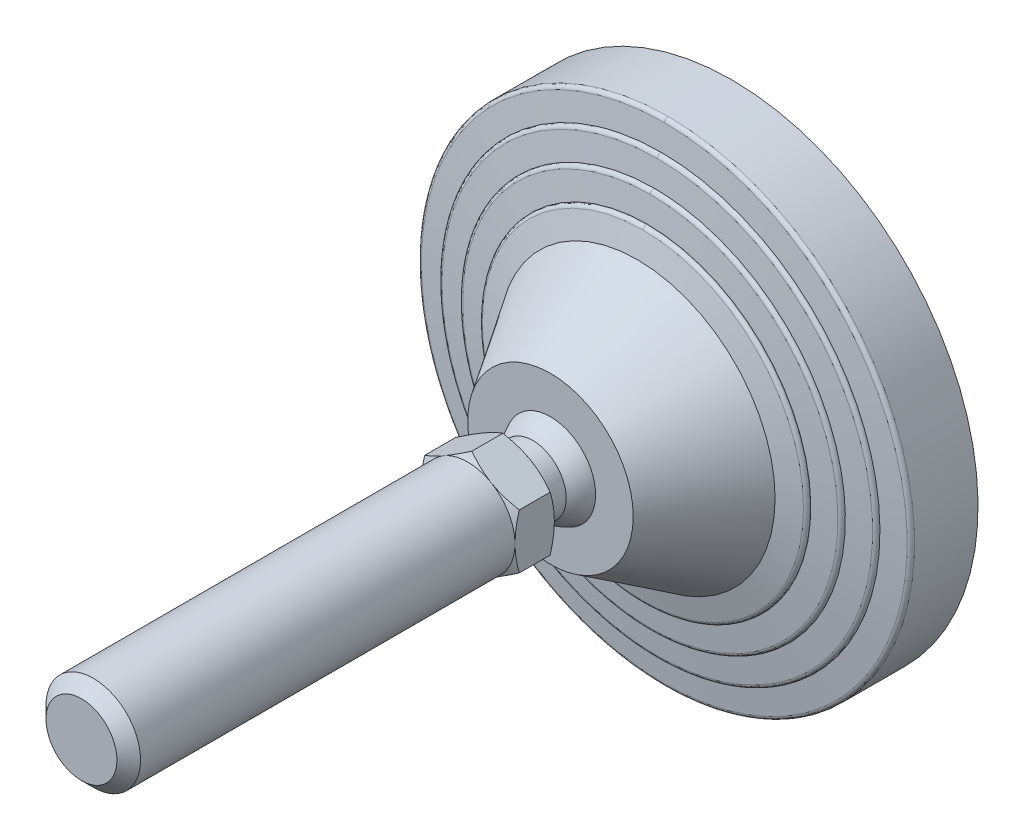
ISO-10303-21;
HEADER;
FILE_DESCRIPTION(('STEP AP214'),'2;1');
FILE_NAME('part.step','',(''),(''),'','','');
FILE_SCHEMA(('AUTOMOTIVE_DESIGN { 1 0 10303 214 1 1 1 1 }'));
ENDSEC;
DATA;
#1=APPLICATION_CONTEXT('core data for automotive mechanical design processes');
#2=APPLICATION_PROTOCOL_DEFINITION('international standard','automotive_design',2000,#1);
#3=PRODUCT_CONTEXT('',#1,'mechanical');
#4=PRODUCT('Part','Part','',(#3));
#5=PRODUCT_RELATED_PRODUCT_CATEGORY('part','',(#4));
#6=PRODUCT_DEFINITION_FORMATION('','',#4);
#7=PRODUCT_DEFINITION_CONTEXT('part definition',#1,'design');
#8=PRODUCT_DEFINITION('design','',#6,#7);
#9=PRODUCT_DEFINITION_SHAPE('','',#8);
#10=(LENGTH_UNIT() NAMED_UNIT(*) SI_UNIT(.MILLI.,.METRE.));
#11=(NAMED_UNIT(*) PLANE_ANGLE_UNIT() SI_UNIT($,.RADIAN.));
#12=(NAMED_UNIT(*) SI_UNIT($,.STERADIAN.) SOLID_ANGLE_UNIT());
#13=UNCERTAINTY_MEASURE_WITH_UNIT(LENGTH_MEASURE(1.E-05),#10,'distance_accuracy_value','');
#14=(GEOMETRIC_REPRESENTATION_CONTEXT(3) GLOBAL_UNCERTAINTY_ASSIGNED_CONTEXT((#13)) GLOBAL_UNIT_ASSIGNED_CONTEXT((#10,
#11,#12)) REPRESENTATION_CONTEXT('',''));
#15=CARTESIAN_POINT('',(0.,0.,0.));
#16=DIRECTION('',(0.,0.,1.));
#17=DIRECTION('',(1.,0.,0.));
#18=AXIS2_PLACEMENT_3D('',#15,#16,#17);
#19=CARTESIAN_POINT('',(-55.851524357,55.66,0.));
#20=DIRECTION('',(0.,0.,1.));
#21=DIRECTION('',(0.,-1.,0.));
#22=AXIS2_PLACEMENT_3D('',#19,#20,#21);
#23=PLANE('',#22);
#24=CARTESIAN_POINT('',(0.,0.,0.));
#25=DIRECTION('',(0.,0.,-1.));
#26=DIRECTION('',(0.,1.,0.));
#27=AXIS2_PLACEMENT_3D('',#24,#25,#26);
#28=CIRCLE('',#27,55.);
#29=CARTESIAN_POINT('',(0.,55.,0.));
#30=VERTEX_POINT('',#29);
#31=EDGE_CURVE('E431',#30,#30,#28,.F.);
#32=ORIENTED_EDGE('',*,*,#31,.F.);
#33=EDGE_LOOP('',(#32));
#34=FACE_BOUND('',#33,.T.);
#35=ADVANCED_FACE('F14',(#34),#23,.F.);
#36=CARTESIAN_POINT('',(0.,0.,3.));
#37=DIRECTION('',(0.,0.,-1.));
#38=DIRECTION('',(0.,1.,0.));
#39=AXIS2_PLACEMENT_3D('',#36,#37,#38);
#40=CYLINDRICAL_SURFACE('',#39,55.);
#41=ORIENTED_EDGE('',*,*,#31,.T.);
#42=EDGE_LOOP('',(#41));
#43=FACE_BOUND('',#42,.T.);
#44=CARTESIAN_POINT('',(0.,0.,3.));
#45=DIRECTION('',(0.,0.,-1.));
#46=DIRECTION('',(0.,1.,0.));
#47=AXIS2_PLACEMENT_3D('',#44,#45,#46);
#48=CIRCLE('',#47,55.);
#49=CARTESIAN_POINT('',(0.,55.,3.));
#50=VERTEX_POINT('',#49);
#51=EDGE_CURVE('E428',#50,#50,#48,.T.);
#52=ORIENTED_EDGE('',*,*,#51,.T.);
#53=EDGE_LOOP('',(#52));
#54=FACE_BOUND('',#53,.T.);
#55=ADVANCED_FACE('F287',(#43,#54),#40,.T.);
#56=CARTESIAN_POINT('',(-63.467641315,63.25,3.));
#57=DIRECTION('',(0.,0.,1.));
#58=DIRECTION('',(0.,-1.,0.));
#59=AXIS2_PLACEMENT_3D('',#56,#57,#58);
#60=PLANE('',#59);
#61=ORIENTED_EDGE('',*,*,#51,.F.);
#62=EDGE_LOOP('',(#61));
#63=FACE_BOUND('',#62,.T.);
#64=CARTESIAN_POINT('',(0.,0.,3.));
#65=DIRECTION('',(0.,0.,-1.));
#66=DIRECTION('',(0.,1.,0.));
#67=AXIS2_PLACEMENT_3D('',#64,#65,#66);
#68=CIRCLE('',#67,62.5);
#69=CARTESIAN_POINT('',(0.,62.5,3.));
#70=VERTEX_POINT('',#69);
#71=EDGE_CURVE('E424',#70,#70,#68,.F.);
#72=ORIENTED_EDGE('',*,*,#71,.F.);
#73=EDGE_LOOP('',(#72));
#74=FACE_BOUND('',#73,.T.);
#75=ADVANCED_FACE('F283',(#63,#74),#60,.F.);
#76=CARTESIAN_POINT('',(0.,0.,19.119206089));
#77=DIRECTION('',(0.,0.,-1.));
#78=DIRECTION('',(0.,1.,0.));
#79=AXIS2_PLACEMENT_3D('',#76,#77,#78);
#80=CYLINDRICAL_SURFACE('',#79,62.5);
#81=ORIENTED_EDGE('',*,*,#71,.T.);
#82=EDGE_LOOP('',(#81));
#83=FACE_BOUND('',#82,.T.);
#84=CARTESIAN_POINT('',(0.,0.,19.119206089));
#85=DIRECTION('',(0.,0.,1.));
#86=DIRECTION('',(0.,-1.,0.));
#87=AXIS2_PLACEMENT_3D('',#84,#85,#86);
#88=CIRCLE('',#87,62.5);
#89=CARTESIAN_POINT('',(-6.4094821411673E-09,-62.5,19.119206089));
#90=VERTEX_POINT('',#89);
#91=CARTESIAN_POINT('',(0.,62.5,19.119206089));
#92=VERTEX_POINT('',#91);
#93=EDGE_CURVE('E583',#90,#92,#88,.T.);
#94=ORIENTED_EDGE('',*,*,#93,.F.);
#95=CARTESIAN_POINT('',(0.,0.,19.119206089));
#96=DIRECTION('',(0.,0.,1.));
#97=DIRECTION('',(0.,-1.,0.));
#98=AXIS2_PLACEMENT_3D('',#95,#96,#97);
#99=CIRCLE('',#98,62.5);
#100=EDGE_CURVE('E427',#92,#90,#99,.T.);
#101=ORIENTED_EDGE('',*,*,#100,.F.);
#102=EDGE_LOOP('',(#94,#101));
#103=FACE_BOUND('',#102,.T.);
#104=ADVANCED_FACE('F286',(#83,#103),#80,.T.);
#105=CARTESIAN_POINT('',(0.,-62.5,19.119206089));
#106=CARTESIAN_POINT('',(-125.,-62.5,19.119206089));
#107=CARTESIAN_POINT('',(-125.,62.5,19.119206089));
#108=CARTESIAN_POINT('',(0.,62.5,19.119206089));
#109=CARTESIAN_POINT('',(0.,-62.5,19.647800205));
#110=CARTESIAN_POINT('',(-125.,-62.5000000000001,19.647800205));
#111=CARTESIAN_POINT('',(-125.,62.5000000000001,19.647800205));
#112=CARTESIAN_POINT('',(0.,62.5,19.647800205));
#113=CARTESIAN_POINT('',(0.,-62.150618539,20.044466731));
#114=CARTESIAN_POINT('',(-124.301237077,-62.150618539,20.044466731));
#115=CARTESIAN_POINT('',(-124.301237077,62.150618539,20.044466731));
#116=CARTESIAN_POINT('',(0.,62.150618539,20.044466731));
#117=CARTESIAN_POINT('',(0.,-61.62625428,20.111204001));
#118=CARTESIAN_POINT('',(-123.252508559,-61.6262542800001,20.111204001));
#119=CARTESIAN_POINT('',(-123.252508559,61.6262542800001,20.111204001));
#120=CARTESIAN_POINT('',(0.,61.62625428,20.111204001));
#121=(BOUNDED_SURFACE() B_SPLINE_SURFACE(3,3,((#105,#106,#107,#108),(#109,#110,#111,#112),(#113,
#114,#115,#116),(#117,#118,#119,#120)),.UNSPECIFIED.,.F.,.F.,
.F.) B_SPLINE_SURFACE_WITH_KNOTS((4,4),(4,4),(0.,1.),(0.,1.),
.UNSPECIFIED.) GEOMETRIC_REPRESENTATION_ITEM() RATIONAL_B_SPLINE_SURFACE(((1.,0.333333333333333,
0.333333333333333,1.),(0.833611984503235,0.277870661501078,0.277870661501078,0.833611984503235),
(0.833611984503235,0.277870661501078,0.277870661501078,0.833611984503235),(1.,0.333333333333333,
0.333333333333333,1.))) REPRESENTATION_ITEM('') SURFACE());
#122=CARTESIAN_POINT('',(0.,62.5,19.119206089));
#123=CARTESIAN_POINT('',(0.,62.5,19.647800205));
#124=CARTESIAN_POINT('',(0.,62.150618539,20.044466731));
#125=CARTESIAN_POINT('',(0.,61.62625428,20.111204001));
#126=(BOUNDED_CURVE() B_SPLINE_CURVE(3,(#122,#123,#124,#125),.UNSPECIFIED.,.F.,
.F.) B_SPLINE_CURVE_WITH_KNOTS((4,4),(0.,1.),
.UNSPECIFIED.) CURVE() GEOMETRIC_REPRESENTATION_ITEM() RATIONAL_B_SPLINE_CURVE((1.,
0.833611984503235,0.833611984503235,1.)) REPRESENTATION_ITEM(''));
#127=CARTESIAN_POINT('',(0.,61.6262542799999,20.1112040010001));
#128=VERTEX_POINT('',#127);
#129=EDGE_CURVE('E574',#92,#128,#126,.T.);
#130=CARTESIAN_POINT('',(0.,-62.5,19.119206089));
#131=CARTESIAN_POINT('',(0.,-62.5,19.647800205));
#132=CARTESIAN_POINT('',(0.,-62.150618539,20.044466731));
#133=CARTESIAN_POINT('',(0.,-61.62625428,20.111204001));
#134=(BOUNDED_CURVE() B_SPLINE_CURVE(3,(#130,#131,#132,#133),.UNSPECIFIED.,.F.,
.F.) B_SPLINE_CURVE_WITH_KNOTS((4,4),(0.,1.),
.UNSPECIFIED.) CURVE() GEOMETRIC_REPRESENTATION_ITEM() RATIONAL_B_SPLINE_CURVE((1.,
0.833611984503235,0.833611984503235,1.)) REPRESENTATION_ITEM(''));
#135=CARTESIAN_POINT('',(-1.89596340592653E-08,-61.6262542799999,20.1112040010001));
#136=VERTEX_POINT('',#135);
#137=EDGE_CURVE('E588',#136,#90,#134,.F.);
#138=CARTESIAN_POINT('',(0.,0.,20.1112040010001));
#139=DIRECTION('',(0.,0.,-1.));
#140=DIRECTION('',(0.,1.,0.));
#141=AXIS2_PLACEMENT_3D('',#138,#139,#140);
#142=CIRCLE('',#141,61.62625428);
#143=EDGE_CURVE('E567',#128,#136,#142,.F.);
#144=ORIENTED_EDGE('',*,*,#129,.F.);
#145=ORIENTED_EDGE('',*,*,#100,.T.);
#146=ORIENTED_EDGE('',*,*,#137,.F.);
#147=ORIENTED_EDGE('',*,*,#143,.F.);
#148=EDGE_LOOP('',(#144,#145,#146,#147));
#149=FACE_BOUND('',#148,.T.);
#150=ADVANCED_FACE('F944',(#149),#121,.T.);
#151=CARTESIAN_POINT('',(0.,62.5,19.119206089));
#152=CARTESIAN_POINT('',(125.,62.5,19.119206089));
#153=CARTESIAN_POINT('',(125.,-62.5,19.119206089));
#154=CARTESIAN_POINT('',(0.,-62.5,19.119206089));
#155=CARTESIAN_POINT('',(0.,62.5,19.647800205));
#156=CARTESIAN_POINT('',(125.,62.5000000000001,19.647800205));
#157=CARTESIAN_POINT('',(125.,-62.5000000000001,19.647800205));
#158=CARTESIAN_POINT('',(0.,-62.5,19.647800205));
#159=CARTESIAN_POINT('',(0.,62.150618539,20.044466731));
#160=CARTESIAN_POINT('',(124.301237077,62.150618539,20.044466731));
#161=CARTESIAN_POINT('',(124.301237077,-62.150618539,20.044466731));
#162=CARTESIAN_POINT('',(0.,-62.150618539,20.044466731));
#163=CARTESIAN_POINT('',(0.,61.62625428,20.111204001));
#164=CARTESIAN_POINT('',(123.252508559,61.6262542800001,20.111204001));
#165=CARTESIAN_POINT('',(123.252508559,-61.6262542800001,20.111204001));
#166=CARTESIAN_POINT('',(0.,-61.62625428,20.111204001));
#167=(BOUNDED_SURFACE() B_SPLINE_SURFACE(3,3,((#151,#152,#153,#154),(#155,#156,#157,#158),(#159,
#160,#161,#162),(#163,#164,#165,#166)),.UNSPECIFIED.,.F.,.F.,
.F.) B_SPLINE_SURFACE_WITH_KNOTS((4,4),(4,4),(0.,1.),(0.,1.),
.UNSPECIFIED.) GEOMETRIC_REPRESENTATION_ITEM() RATIONAL_B_SPLINE_SURFACE(((1.,0.333333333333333,
0.333333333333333,1.),(0.833611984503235,0.277870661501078,0.277870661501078,0.833611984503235),
(0.833611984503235,0.277870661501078,0.277870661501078,0.833611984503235),(1.,0.333333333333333,
0.333333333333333,1.))) REPRESENTATION_ITEM('') SURFACE());
#168=CARTESIAN_POINT('',(0.,0.,20.1112040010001));
#169=DIRECTION('',(0.,0.,-1.));
#170=DIRECTION('',(0.,1.,0.));
#171=AXIS2_PLACEMENT_3D('',#168,#169,#170);
#172=CIRCLE('',#171,61.62625428);
#173=EDGE_CURVE('E573',#136,#128,#172,.F.);
#174=ORIENTED_EDGE('',*,*,#93,.T.);
#175=ORIENTED_EDGE('',*,*,#129,.T.);
#176=ORIENTED_EDGE('',*,*,#173,.F.);
#177=ORIENTED_EDGE('',*,*,#137,.T.);
#178=EDGE_LOOP('',(#174,#175,#176,#177));
#179=FACE_BOUND('',#178,.T.);
#180=ADVANCED_FACE('F409',(#179),#167,.T.);
#181=CARTESIAN_POINT('',(0.,0.,20.890909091));
#182=DIRECTION('',(0.,0.,-1.));
#183=DIRECTION('',(1.,0.,0.));
#184=AXIS2_PLACEMENT_3D('',#181,#182,#183);
#185=CONICAL_SURFACE('',#184,55.5,1.44420419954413);
#186=ORIENTED_EDGE('',*,*,#143,.T.);
#187=ORIENTED_EDGE('',*,*,#173,.T.);
#188=EDGE_LOOP('',(#186,#187));
#189=FACE_BOUND('',#188,.T.);
#190=CARTESIAN_POINT('',(-1.13830957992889E-08,-55.5,20.890909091));
#191=CARTESIAN_POINT('',(0.666810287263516,-55.5000058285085,20.890909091));
#192=CARTESIAN_POINT('',(1.33362158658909,-55.4879831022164,20.890909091));
#193=CARTESIAN_POINT('',(2.66828219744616,-55.4398527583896,20.890909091));
#194=CARTESIAN_POINT('',(3.33612903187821,-55.4036764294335,20.890909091));
#195=CARTESIAN_POINT('',(4.67008368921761,-55.3072108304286,20.890909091));
#196=CARTESIAN_POINT('',(5.33619149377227,-55.2469213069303,20.890909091));
#197=CARTESIAN_POINT('',(6.66630694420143,-55.1022519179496,20.890909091));
#198=CARTESIAN_POINT('',(7.33031261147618,-55.0178537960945,20.890909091));
#199=CARTESIAN_POINT('',(8.65488946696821,-54.825094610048,20.890909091));
#200=CARTESIAN_POINT('',(9.31546019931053,-54.7167304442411,20.890909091));
#201=CARTESIAN_POINT('',(11.3032442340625,-54.3535835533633,20.890909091));
#202=CARTESIAN_POINT('',(12.6239565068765,-54.062110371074,20.890909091));
#203=CARTESIAN_POINT('',(15.2407929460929,-53.3834839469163,20.890909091));
#204=CARTESIAN_POINT('',(16.536910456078,-52.9963051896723,20.890909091));
#205=CARTESIAN_POINT('',(19.0989356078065,-52.127842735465,20.890909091));
#206=CARTESIAN_POINT('',(20.3648068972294,-51.6464516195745,20.890909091));
#207=CARTESIAN_POINT('',(22.8579438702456,-50.5924539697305,20.890909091));
#208=CARTESIAN_POINT('',(24.0852091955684,-50.0198465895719,20.890909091));
#209=CARTESIAN_POINT('',(26.6786676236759,-48.6922162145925,20.890909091));
#210=CARTESIAN_POINT('',(28.0374663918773,-47.9226902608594,20.890909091));
#211=CARTESIAN_POINT('',(30.6855194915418,-46.2718474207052,20.890909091));
#212=CARTESIAN_POINT('',(31.974765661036,-45.3905174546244,20.890909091));
#213=CARTESIAN_POINT('',(34.4745529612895,-43.5222940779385,20.890909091));
#214=CARTESIAN_POINT('',(35.6850872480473,-42.5353915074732,20.890909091));
#215=CARTESIAN_POINT('',(38.0186685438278,-40.4631409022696,20.890909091));
#216=CARTESIAN_POINT('',(39.1417181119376,-39.3777957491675,20.890909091));
#217=CARTESIAN_POINT('',(41.2923479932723,-37.1163936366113,20.890909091));
#218=CARTESIAN_POINT('',(42.3199319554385,-35.9403401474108,20.890909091));
#219=CARTESIAN_POINT('',(44.2723789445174,-33.5058382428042,20.890909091));
#220=CARTESIAN_POINT('',(45.1972412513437,-32.2473892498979,20.890909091));
#221=CARTESIAN_POINT('',(46.9376312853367,-29.6570957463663,20.890909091));
#222=CARTESIAN_POINT('',(47.7531628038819,-28.3252537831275,20.890909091));
#223=CARTESIAN_POINT('',(49.2691299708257,-25.5976050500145,20.890909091));
#224=CARTESIAN_POINT('',(49.9695658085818,-24.201798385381,20.890909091));
#225=CARTESIAN_POINT('',(51.2503706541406,-21.3561258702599,20.890909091));
#226=CARTESIAN_POINT('',(51.8307383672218,-19.9062594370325,20.890909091));
#227=CARTESIAN_POINT('',(52.8672716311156,-16.9627885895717,20.890909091));
#228=CARTESIAN_POINT('',(53.3234371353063,-15.4691841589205,20.890909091));
#229=CARTESIAN_POINT('',(54.1083272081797,-12.4488388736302,20.890909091));
#230=CARTESIAN_POINT('',(54.4370503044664,-10.9220976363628,20.890909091));
#231=CARTESIAN_POINT('',(54.964711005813,-7.84634988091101,20.890909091));
#232=CARTESIAN_POINT('',(55.1636486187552,-6.29734336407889,20.890909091));
#233=CARTESIAN_POINT('',(55.4303245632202,-3.18807153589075,20.890909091));
#234=CARTESIAN_POINT('',(55.4980623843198,-1.62780618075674,20.890909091));
#235=CARTESIAN_POINT('',(55.5018556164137,1.49288460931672,20.890909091));
#236=CARTESIAN_POINT('',(55.4379110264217,3.05331004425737,20.890909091));
#237=CARTESIAN_POINT('',(55.1787965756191,6.16319684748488,20.890909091));
#238=CARTESIAN_POINT('',(54.9836292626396,7.71265842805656,20.890909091));
#239=CARTESIAN_POINT('',(54.463459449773,10.7896325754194,20.890909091));
#240=CARTESIAN_POINT('',(54.1384569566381,12.3171451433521,20.890909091));
#241=CARTESIAN_POINT('',(53.3609336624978,15.3393372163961,20.890909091));
#242=CARTESIAN_POINT('',(52.9084149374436,16.8340172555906,20.890909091));
#243=CARTESIAN_POINT('',(51.8790738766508,19.7799443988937,20.890909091));
#244=CARTESIAN_POINT('',(51.3022515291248,21.2311914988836,20.890909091));
#245=CARTESIAN_POINT('',(50.0283709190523,24.0800097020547,20.890909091));
#246=CARTESIAN_POINT('',(49.3313064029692,25.4775780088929,20.890909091));
#247=CARTESIAN_POINT('',(47.8219174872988,28.2090226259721,20.890909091));
#248=CARTESIAN_POINT('',(47.009593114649,29.5428989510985,20.890909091));
#249=CARTESIAN_POINT('',(45.275439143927,32.137509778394,20.890909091));
#250=CARTESIAN_POINT('',(44.3536065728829,33.3982422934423,20.890909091));
#251=CARTESIAN_POINT('',(42.4069961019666,35.8375708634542,20.890909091));
#252=CARTESIAN_POINT('',(41.3822180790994,37.0161668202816,20.890909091));
#253=CARTESIAN_POINT('',(39.2371577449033,39.28269451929,20.890909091));
#254=CARTESIAN_POINT('',(38.11688550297,40.3706357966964,20.890909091));
#255=CARTESIAN_POINT('',(35.7885615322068,42.4483529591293,20.890909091));
#256=CARTESIAN_POINT('',(34.580510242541,43.4381293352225,20.890909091));
#257=CARTESIAN_POINT('',(32.5014047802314,44.999906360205,20.890909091));
#258=CARTESIAN_POINT('',(31.6521856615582,45.6012216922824,20.890909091));
#259=CARTESIAN_POINT('',(29.9212415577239,46.7552239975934,20.890909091));
#260=CARTESIAN_POINT('',(29.0395163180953,47.3079105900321,20.890909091));
#261=CARTESIAN_POINT('',(27.2463975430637,48.3628576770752,20.890909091));
#262=CARTESIAN_POINT('',(26.3350034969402,48.8651173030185,20.890909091));
#263=CARTESIAN_POINT('',(24.4853750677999,49.8176528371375,20.890909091));
#264=CARTESIAN_POINT('',(23.5471392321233,50.2679259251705,20.890909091));
#265=CARTESIAN_POINT('',(21.6468644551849,51.1150215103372,20.890909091));
#266=CARTESIAN_POINT('',(20.6848259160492,51.5118449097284,20.890909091));
#267=CARTESIAN_POINT('',(18.7400290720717,52.2507726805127,20.890909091));
#268=CARTESIAN_POINT('',(17.7572723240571,52.5928811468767,20.890909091));
#269=CARTESIAN_POINT('',(15.8636176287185,53.1929617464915,20.890909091));
#270=CARTESIAN_POINT('',(14.9542390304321,53.4557406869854,20.890909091));
#271=CARTESIAN_POINT('',(13.1232854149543,53.9344479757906,20.890909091));
#272=CARTESIAN_POINT('',(12.2017111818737,54.1503793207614,20.890909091));
#273=CARTESIAN_POINT('',(10.3487557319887,54.5348378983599,20.890909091));
#274=CARTESIAN_POINT('',(9.41737477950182,54.7033664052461,20.890909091));
#275=CARTESIAN_POINT('',(7.54728204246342,54.9925789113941,20.890909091));
#276=CARTESIAN_POINT('',(6.60857079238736,55.1132663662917,20.890909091));
#277=CARTESIAN_POINT('',(4.72616569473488,55.3064952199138,20.890909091));
#278=CARTESIAN_POINT('',(3.78247163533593,55.3790345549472,20.890909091));
#279=CARTESIAN_POINT('',(1.8925192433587,55.4758006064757,20.890909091));
#280=CARTESIAN_POINT('',(0.946260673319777,55.5000226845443,20.890909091));
#281=CARTESIAN_POINT('',(-1.66116564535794E-09,55.5,20.890909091));
#282=B_SPLINE_CURVE_WITH_KNOTS('',3,(#190,#191,#192,#193,#194,#195,#196,#197,#198,#199,#200,
#201,#202,#203,#204,#205,#206,#207,#208,#209,#210,#211,#212,#213,#214,#215,#216,#217,#218,#219,
#220,#221,#222,#223,#224,#225,#226,#227,#228,#229,#230,#231,#232,#233,#234,#235,#236,#237,#238,
#239,#240,#241,#242,#243,#244,#245,#246,#247,#248,#249,#250,#251,#252,#253,#254,#255,#256,#257,
#258,#259,#260,#261,#262,#263,#264,#265,#266,#267,#268,#269,#270,#271,#272,#273,#274,#275,#276,
#277,#278,#279,#280,#281),.UNSPECIFIED.,.F.,.F.,(4,2,2,2,2,2,2,2,2,2,2,2,2,2,2,2,2,2,2,2,2,2,2,
2,2,2,2,2,2,2,2,2,2,2,2,2,2,2,2,2,2,2,2,2,2,4),(0.,2.00032482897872,4.00636450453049,
6.01242526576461,8.02000917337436,10.0278530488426,14.081391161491,18.1360111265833,
22.1952813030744,26.2545891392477,30.9336173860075,35.6131935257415,40.2931760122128,
44.9730215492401,49.6526881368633,54.332387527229,59.0119245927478,63.6914539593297,
68.3710337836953,73.0506153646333,77.7302510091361,82.4098863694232,87.0895399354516,
91.7691935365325,96.4487562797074,101.128318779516,105.807805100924,110.487291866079,
115.167022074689,119.846751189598,124.526607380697,129.206469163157,133.885838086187,
138.565183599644,141.685351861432,144.805544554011,147.9257909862,151.046206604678,
154.166569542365,157.286698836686,160.125236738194,162.963593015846,165.801872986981,
168.63994790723,171.478144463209,174.316613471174),.UNSPECIFIED.);
#283=CARTESIAN_POINT('',(-1.1383239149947E-08,-55.5,20.895966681));
#284=VERTEX_POINT('',#283);
#285=CARTESIAN_POINT('',(-1.66118325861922E-09,55.5,20.895966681));
#286=VERTEX_POINT('',#285);
#287=EDGE_CURVE('E390',#284,#286,#282,.T.);
#288=ORIENTED_EDGE('',*,*,#287,.F.);
#289=CARTESIAN_POINT('',(-1.66117986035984E-09,55.5,20.890909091));
#290=CARTESIAN_POINT('',(-0.666810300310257,55.5000058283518,20.890909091));
#291=CARTESIAN_POINT('',(-1.33362159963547,55.4879831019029,20.890909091));
#292=CARTESIAN_POINT('',(-2.66828221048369,55.4398527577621,20.890909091));
#293=CARTESIAN_POINT('',(-3.33612904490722,55.403676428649,20.890909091));
#294=CARTESIAN_POINT('',(-4.67008370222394,55.3072108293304,20.890909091));
#295=CARTESIAN_POINT('',(-5.33619150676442,55.2469213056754,20.890909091));
#296=CARTESIAN_POINT('',(-6.66630695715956,55.1022519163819,20.890909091));
#297=CARTESIAN_POINT('',(-7.33031262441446,55.0178537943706,20.890909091));
#298=CARTESIAN_POINT('',(-8.65488947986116,54.8250946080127,20.890909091));
#299=CARTESIAN_POINT('',(-9.315460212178,54.7167304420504,20.890909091));
#300=CARTESIAN_POINT('',(-11.3032442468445,54.3535835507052,20.890909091));
#301=CARTESIAN_POINT('',(-12.62395651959,54.0621103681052,20.890909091));
#302=CARTESIAN_POINT('',(-15.2407929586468,53.3834839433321,20.890909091));
#303=CARTESIAN_POINT('',(-16.5369104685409,52.9963051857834,20.890909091));
#304=CARTESIAN_POINT('',(-19.0989356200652,52.1278427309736,20.890909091));
#305=CARTESIAN_POINT('',(-20.3648069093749,51.6464516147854,20.890909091));
#306=CARTESIAN_POINT('',(-22.8579438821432,50.5924539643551,20.890909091));
#307=CARTESIAN_POINT('',(-24.0852092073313,50.0198465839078,20.890909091));
#308=CARTESIAN_POINT('',(-26.6786676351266,48.6922162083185,20.890909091));
#309=CARTESIAN_POINT('',(-28.037466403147,47.9226902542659,20.890909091));
#310=CARTESIAN_POINT('',(-30.6855195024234,46.271847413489,20.890909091));
#311=CARTESIAN_POINT('',(-31.9747656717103,45.390517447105,20.890909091));
#312=CARTESIAN_POINT('',(-34.4745529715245,43.5222940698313,20.890909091));
#313=CARTESIAN_POINT('',(-35.6850872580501,42.5353914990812,20.890909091));
#314=CARTESIAN_POINT('',(-38.0186685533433,40.4631408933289,20.890909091));
#315=CARTESIAN_POINT('',(-39.1417181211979,39.3777957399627,20.890909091));
#316=CARTESIAN_POINT('',(-41.2923480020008,37.1163936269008,20.890909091));
#317=CARTESIAN_POINT('',(-42.3199319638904,35.9403401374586,20.890909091));
#318=CARTESIAN_POINT('',(-44.2723789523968,33.5058382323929,20.890909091));
#319=CARTESIAN_POINT('',(-45.1972412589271,32.247389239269,20.890909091));
#320=CARTESIAN_POINT('',(-46.937631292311,29.6570957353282,20.890909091));
#321=CARTESIAN_POINT('',(-47.753162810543,28.3252537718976,20.890909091));
#322=CARTESIAN_POINT('',(-49.2691299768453,25.597605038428,20.890909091));
#323=CARTESIAN_POINT('',(-49.9695658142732,24.2017983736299,20.890909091));
#324=CARTESIAN_POINT('',(-51.2503706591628,21.3561258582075,20.890909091));
#325=CARTESIAN_POINT('',(-51.8307383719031,19.9062594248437,20.890909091));
#326=CARTESIAN_POINT('',(-52.8672716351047,16.9627885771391,20.890909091));
#327=CARTESIAN_POINT('',(-53.3234371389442,15.4691841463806,20.890909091));
#328=CARTESIAN_POINT('',(-54.1083272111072,12.4488388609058,20.890909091));
#329=CARTESIAN_POINT('',(-54.437050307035,10.9220976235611,20.890909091));
#330=CARTESIAN_POINT('',(-54.9647110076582,7.84634986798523,20.890909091));
#331=CARTESIAN_POINT('',(-55.1636486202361,6.29734335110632,20.890909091));
#332=CARTESIAN_POINT('',(-55.4303245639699,3.1880715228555,20.890909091));
#333=CARTESIAN_POINT('',(-55.4980623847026,1.62780616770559,20.890909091));
#334=CARTESIAN_POINT('',(-55.5018556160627,-1.4928846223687,20.890909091));
#335=CARTESIAN_POINT('',(-55.4379110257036,-3.05331005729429,20.890909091));
#336=CARTESIAN_POINT('',(-55.1787965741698,-6.16319686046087,20.890909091));
#337=CARTESIAN_POINT('',(-54.9836292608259,-7.71265844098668,20.890909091));
#338=CARTESIAN_POINT('',(-54.4634594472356,-10.7896325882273,20.890909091));
#339=CARTESIAN_POINT('',(-54.1384569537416,-12.3171451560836,20.890909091));
#340=CARTESIAN_POINT('',(-53.3609336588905,-15.3393372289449,20.890909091));
#341=CARTESIAN_POINT('',(-52.9084149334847,-16.8340172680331,20.890909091));
#342=CARTESIAN_POINT('',(-51.8790738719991,-19.7799444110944,20.890909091));
#343=CARTESIAN_POINT('',(-51.3022515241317,-21.2311915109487,20.890909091));
#344=CARTESIAN_POINT('',(-50.0283709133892,-24.0800097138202,20.890909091));
#345=CARTESIAN_POINT('',(-49.3313063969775,-25.4775780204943,20.890909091));
#346=CARTESIAN_POINT('',(-47.8219174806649,-28.2090226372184,20.890909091));
#347=CARTESIAN_POINT('',(-47.0095931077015,-29.5428989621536,20.890909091));
#348=CARTESIAN_POINT('',(-45.2754391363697,-32.1375097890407,20.890909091));
#349=CARTESIAN_POINT('',(-44.3536065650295,-33.3982423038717,20.890909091));
#350=CARTESIAN_POINT('',(-42.4069960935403,-35.837570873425,20.890909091));
#351=CARTESIAN_POINT('',(-41.3822180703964,-37.0161668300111,20.890909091));
#352=CARTESIAN_POINT('',(-39.2371577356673,-39.2826945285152,20.890909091));
#353=CARTESIAN_POINT('',(-38.1168854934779,-40.3706358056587,20.890909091));
#354=CARTESIAN_POINT('',(-35.7885615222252,-42.4483529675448,20.890909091));
#355=CARTESIAN_POINT('',(-34.5805102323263,-43.4381293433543,20.890909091));
#356=CARTESIAN_POINT('',(-32.5014047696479,-44.9999063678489,20.890909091));
#357=CARTESIAN_POINT('',(-31.6521856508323,-45.6012216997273,20.890909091));
#358=CARTESIAN_POINT('',(-29.9212415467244,-46.7552240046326,20.890909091));
#359=CARTESIAN_POINT('',(-29.0395163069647,-47.3079105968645,20.890909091));
#360=CARTESIAN_POINT('',(-27.2463975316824,-48.3628576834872,20.890909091));
#361=CARTESIAN_POINT('',(-26.3350034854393,-48.8651173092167,20.890909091));
#362=CARTESIAN_POINT('',(-24.4853750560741,-49.8176528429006,20.890909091));
#363=CARTESIAN_POINT('',(-23.5471392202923,-50.2679259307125,20.890909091));
#364=CARTESIAN_POINT('',(-21.6468644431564,-51.1150215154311,20.890909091));
#365=CARTESIAN_POINT('',(-20.6848259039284,-51.5118449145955,20.890909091));
#366=CARTESIAN_POINT('',(-18.74002905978,-52.2507726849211,20.890909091));
#367=CARTESIAN_POINT('',(-17.7572723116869,-52.5928811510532,20.890909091));
#368=CARTESIAN_POINT('',(-15.8636176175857,-53.192961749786,20.890909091));
#369=CARTESIAN_POINT('',(-14.9542390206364,-53.4557406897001,20.890909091));
#370=CARTESIAN_POINT('',(-13.1232854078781,-53.934447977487,20.890909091));
#371=CARTESIAN_POINT('',(-12.20171117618,-54.1503793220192,20.890909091));
#372=CARTESIAN_POINT('',(-10.3487557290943,-54.5348378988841,20.890909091));
#373=CARTESIAN_POINT('',(-9.41737477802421,-54.7033664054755,20.890909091));
#374=CARTESIAN_POINT('',(-7.54728204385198,-54.9925789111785,20.890909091));
#375=CARTESIAN_POINT('',(-6.60857079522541,-55.1132663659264,20.890909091));
#376=CARTESIAN_POINT('',(-4.72616570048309,-55.3064952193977,20.890909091));
#377=CARTESIAN_POINT('',(-3.7824716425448,-55.37903455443,20.890909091));
#378=CARTESIAN_POINT('',(-1.89251925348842,-55.4758006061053,20.890909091));
#379=CARTESIAN_POINT('',(-0.946260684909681,-55.5000226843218,20.890909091));
#380=CARTESIAN_POINT('',(-1.13832350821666E-08,-55.5,20.890909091));
#381=B_SPLINE_CURVE_WITH_KNOTS('',3,(#289,#290,#291,#292,#293,#294,#295,#296,#297,#298,#299,
#300,#301,#302,#303,#304,#305,#306,#307,#308,#309,#310,#311,#312,#313,#314,#315,#316,#317,#318,
#319,#320,#321,#322,#323,#324,#325,#326,#327,#328,#329,#330,#331,#332,#333,#334,#335,#336,#337,
#338,#339,#340,#341,#342,#343,#344,#345,#346,#347,#348,#349,#350,#351,#352,#353,#354,#355,#356,
#357,#358,#359,#360,#361,#362,#363,#364,#365,#366,#367,#368,#369,#370,#371,#372,#373,#374,#375,
#376,#377,#378,#379,#380),.UNSPECIFIED.,.F.,.F.,(4,2,2,2,2,2,2,2,2,2,2,2,2,2,2,2,2,2,2,2,2,2,2,
2,2,2,2,2,2,2,2,2,2,2,2,2,2,2,2,2,2,2,2,2,2,4),(0.,2.00032482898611,4.00636450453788,
6.01242526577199,8.02000917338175,10.02785304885,14.0813911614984,18.1360111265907,
22.1952813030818,26.2545891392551,30.933617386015,35.6131935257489,40.2931760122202,
44.9730215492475,49.6526881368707,54.3323875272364,59.0119245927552,63.6914539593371,
68.3710337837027,73.0506153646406,77.7302510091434,82.4098863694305,87.0895399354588,
91.7691935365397,96.4487562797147,101.128318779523,105.807805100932,110.487291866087,
115.167022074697,119.846751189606,124.526607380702,129.206469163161,133.885838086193,
138.565183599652,141.685351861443,144.805544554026,147.92579098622,151.046206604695,
154.166569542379,157.286698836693,160.125236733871,162.96359300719,165.801872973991,
168.639947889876,171.478144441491,174.316613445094),.UNSPECIFIED.);
#382=EDGE_CURVE('E402',#286,#284,#381,.T.);
#383=ORIENTED_EDGE('',*,*,#382,.F.);
#384=EDGE_LOOP('',(#288,#383));
#385=FACE_BOUND('',#384,.T.);
#386=ADVANCED_FACE('F404',(#189,#385),#185,.T.);
#387=CARTESIAN_POINT('',(0.,-55.5,20.887804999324));
#388=CARTESIAN_POINT('',(-111.,-55.5000000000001,20.887804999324));
#389=CARTESIAN_POINT('',(-111.,55.5000000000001,20.887804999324));
#390=CARTESIAN_POINT('',(0.,55.5,20.887804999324));
#391=CARTESIAN_POINT('',(0.,-55.5,20.892211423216));
#392=CARTESIAN_POINT('',(-111.,-55.5000000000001,20.892211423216));
#393=CARTESIAN_POINT('',(-111.,55.5000000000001,20.892211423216));
#394=CARTESIAN_POINT('',(0.,55.5,20.892211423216));
#395=CARTESIAN_POINT('',(0.,-55.5,20.896617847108));
#396=CARTESIAN_POINT('',(-111.,-55.5000000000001,20.896617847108));
#397=CARTESIAN_POINT('',(-111.,55.5000000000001,20.896617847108));
#398=CARTESIAN_POINT('',(0.,55.5,20.896617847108));
#399=CARTESIAN_POINT('',(0.,-55.5,20.901024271));
#400=CARTESIAN_POINT('',(-111.,-55.5000000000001,20.901024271));
#401=CARTESIAN_POINT('',(-111.,55.5000000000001,20.901024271));
#402=CARTESIAN_POINT('',(0.,55.5,20.901024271));
#403=CARTESIAN_POINT('',(0.,-55.5,21.429618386));
#404=CARTESIAN_POINT('',(-111.,-55.5,21.429618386));
#405=CARTESIAN_POINT('',(-111.,55.5,21.429618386));
#406=CARTESIAN_POINT('',(0.,55.5,21.429618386));
#407=CARTESIAN_POINT('',(0.,-55.150618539,21.826284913));
#408=CARTESIAN_POINT('',(-110.301237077,-55.1506185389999,21.826284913));
#409=CARTESIAN_POINT('',(-110.301237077,55.1506185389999,21.826284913));
#410=CARTESIAN_POINT('',(0.,55.150618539,21.826284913));
#411=CARTESIAN_POINT('',(0.,-54.62625428,21.893022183));
#412=CARTESIAN_POINT('',(-109.252508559,-54.62625428,21.893022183));
#413=CARTESIAN_POINT('',(-109.252508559,54.62625428,21.893022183));
#414=CARTESIAN_POINT('',(0.,54.62625428,21.893022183));
#415=(BOUNDED_SURFACE() B_SPLINE_SURFACE(3,3,((#387,#388,#389,#390),(#391,#392,#393,#394),(#395,
#396,#397,#398),(#399,#400,#401,#402),(#403,#404,#405,#406),(#407,#408,#409,#410),(#411,#412,
#413,#414)),.UNSPECIFIED.,.F.,.F.,.F.) B_SPLINE_SURFACE_WITH_KNOTS((4,3,4),(4,4),(-0.01,0.,1.),
(0.,1.),.UNSPECIFIED.) GEOMETRIC_REPRESENTATION_ITEM() RATIONAL_B_SPLINE_SURFACE(((1.,
0.333333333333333,0.333333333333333,1.),(1.,0.333333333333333,0.333333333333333,1.),(1.,
0.333333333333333,0.333333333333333,1.),(1.,0.333333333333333,0.333333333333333,1.),
(0.833611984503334,0.277870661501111,0.277870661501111,0.833611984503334),(0.833611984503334,
0.277870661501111,0.277870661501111,0.833611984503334),(1.,0.333333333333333,0.333333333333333,1.))) REPRESENTATION_ITEM('') SURFACE());
#416=CARTESIAN_POINT('',(0.,55.5,20.901024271));
#417=CARTESIAN_POINT('',(0.,55.5,21.429618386));
#418=CARTESIAN_POINT('',(0.,55.150618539,21.826284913));
#419=CARTESIAN_POINT('',(0.,54.62625428,21.893022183));
#420=(BOUNDED_CURVE() B_SPLINE_CURVE(3,(#416,#417,#418,#419),.UNSPECIFIED.,.F.,
.F.) B_SPLINE_CURVE_WITH_KNOTS((4,4),(0.,1.),
.UNSPECIFIED.) CURVE() GEOMETRIC_REPRESENTATION_ITEM() RATIONAL_B_SPLINE_CURVE((1.,
0.833611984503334,0.833611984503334,1.)) REPRESENTATION_ITEM(''));
#421=CARTESIAN_POINT('',(0.,54.6262542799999,21.893022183));
#422=VERTEX_POINT('',#421);
#423=EDGE_CURVE('E393',#286,#422,#420,.T.);
#424=CARTESIAN_POINT('',(0.,-55.5,20.901024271));
#425=CARTESIAN_POINT('',(0.,-55.5,21.429618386));
#426=CARTESIAN_POINT('',(0.,-55.150618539,21.826284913));
#427=CARTESIAN_POINT('',(0.,-54.62625428,21.893022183));
#428=(BOUNDED_CURVE() B_SPLINE_CURVE(3,(#424,#425,#426,#427),.UNSPECIFIED.,.F.,
.F.) B_SPLINE_CURVE_WITH_KNOTS((4,4),(0.,1.),
.UNSPECIFIED.) CURVE() GEOMETRIC_REPRESENTATION_ITEM() RATIONAL_B_SPLINE_CURVE((1.,
0.833611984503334,0.833611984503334,1.)) REPRESENTATION_ITEM(''));
#429=CARTESIAN_POINT('',(-1.68060480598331E-08,-54.6262542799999,21.893022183));
#430=VERTEX_POINT('',#429);
#431=EDGE_CURVE('E394',#430,#284,#428,.F.);
#432=CARTESIAN_POINT('',(0.,0.,21.893022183));
#433=DIRECTION('',(0.,0.,-1.));
#434=DIRECTION('',(0.,1.,0.));
#435=AXIS2_PLACEMENT_3D('',#432,#433,#434);
#436=CIRCLE('',#435,54.62625428);
#437=EDGE_CURVE('E539',#422,#430,#436,.F.);
#438=ORIENTED_EDGE('',*,*,#423,.F.);
#439=ORIENTED_EDGE('',*,*,#382,.T.);
#440=ORIENTED_EDGE('',*,*,#431,.F.);
#441=ORIENTED_EDGE('',*,*,#437,.F.);
#442=EDGE_LOOP('',(#438,#439,#440,#441));
#443=FACE_BOUND('',#442,.T.);
#444=ADVANCED_FACE('F408',(#443),#415,.T.);
#445=CARTESIAN_POINT('',(0.,55.5,20.887804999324));
#446=CARTESIAN_POINT('',(111.,55.5000000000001,20.887804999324));
#447=CARTESIAN_POINT('',(111.,-55.5000000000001,20.887804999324));
#448=CARTESIAN_POINT('',(0.,-55.5,20.887804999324));
#449=CARTESIAN_POINT('',(0.,55.5,20.892211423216));
#450=CARTESIAN_POINT('',(111.,55.5000000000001,20.892211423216));
#451=CARTESIAN_POINT('',(111.,-55.5000000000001,20.892211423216));
#452=CARTESIAN_POINT('',(0.,-55.5,20.892211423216));
#453=CARTESIAN_POINT('',(0.,55.5,20.896617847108));
#454=CARTESIAN_POINT('',(111.,55.5000000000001,20.896617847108));
#455=CARTESIAN_POINT('',(111.,-55.5000000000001,20.896617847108));
#456=CARTESIAN_POINT('',(0.,-55.5,20.896617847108));
#457=CARTESIAN_POINT('',(0.,55.5,20.901024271));
#458=CARTESIAN_POINT('',(111.,55.5000000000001,20.901024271));
#459=CARTESIAN_POINT('',(111.,-55.5000000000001,20.901024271));
#460=CARTESIAN_POINT('',(0.,-55.5,20.901024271));
#461=CARTESIAN_POINT('',(0.,55.5,21.429618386));
#462=CARTESIAN_POINT('',(111.,55.5,21.429618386));
#463=CARTESIAN_POINT('',(111.,-55.5,21.429618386));
#464=CARTESIAN_POINT('',(0.,-55.5,21.429618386));
#465=CARTESIAN_POINT('',(0.,55.150618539,21.826284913));
#466=CARTESIAN_POINT('',(110.301237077,55.1506185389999,21.826284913));
#467=CARTESIAN_POINT('',(110.301237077,-55.1506185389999,21.826284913));
#468=CARTESIAN_POINT('',(0.,-55.150618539,21.826284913));
#469=CARTESIAN_POINT('',(0.,54.62625428,21.893022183));
#470=CARTESIAN_POINT('',(109.252508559,54.62625428,21.893022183));
#471=CARTESIAN_POINT('',(109.252508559,-54.62625428,21.893022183));
#472=CARTESIAN_POINT('',(0.,-54.62625428,21.893022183));
#473=(BOUNDED_SURFACE() B_SPLINE_SURFACE(3,3,((#445,#446,#447,#448),(#449,#450,#451,#452),(#453,
#454,#455,#456),(#457,#458,#459,#460),(#461,#462,#463,#464),(#465,#466,#467,#468),(#469,#470,
#471,#472)),.UNSPECIFIED.,.F.,.F.,.F.) B_SPLINE_SURFACE_WITH_KNOTS((4,3,4),(4,4),(-0.01,0.,1.),
(0.,1.),.UNSPECIFIED.) GEOMETRIC_REPRESENTATION_ITEM() RATIONAL_B_SPLINE_SURFACE(((1.,
0.333333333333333,0.333333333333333,1.),(1.,0.333333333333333,0.333333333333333,1.),(1.,
0.333333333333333,0.333333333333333,1.),(1.,0.333333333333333,0.333333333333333,1.),
(0.833611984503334,0.277870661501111,0.277870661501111,0.833611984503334),(0.833611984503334,
0.277870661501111,0.277870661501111,0.833611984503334),(1.,0.333333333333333,0.333333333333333,1.))) REPRESENTATION_ITEM('') SURFACE());
#474=CARTESIAN_POINT('',(0.,0.,21.893022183));
#475=DIRECTION('',(0.,0.,-1.));
#476=DIRECTION('',(0.,1.,0.));
#477=AXIS2_PLACEMENT_3D('',#474,#475,#476);
#478=CIRCLE('',#477,54.62625428);
#479=EDGE_CURVE('E545',#430,#422,#478,.F.);
#480=ORIENTED_EDGE('',*,*,#287,.T.);
#481=ORIENTED_EDGE('',*,*,#423,.T.);
#482=ORIENTED_EDGE('',*,*,#479,.F.);
#483=ORIENTED_EDGE('',*,*,#431,.T.);
#484=EDGE_LOOP('',(#480,#481,#482,#483));
#485=FACE_BOUND('',#484,.T.);
#486=ADVANCED_FACE('F377',(#485),#473,.T.);
#487=CARTESIAN_POINT('',(0.,0.,22.672727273));
#488=DIRECTION('',(0.,0.,-1.));
#489=DIRECTION('',(0.,1.,0.));
#490=AXIS2_PLACEMENT_3D('',#487,#488,#489);
#491=CONICAL_SURFACE('',#490,48.5,1.44420419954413);
#492=ORIENTED_EDGE('',*,*,#437,.T.);
#493=ORIENTED_EDGE('',*,*,#479,.T.);
#494=EDGE_LOOP('',(#492,#493));
#495=FACE_BOUND('',#494,.T.);
#496=CARTESIAN_POINT('',(-9.9473684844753E-09,-48.5,22.672727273));
#497=CARTESIAN_POINT('',(0.333415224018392,-48.4999999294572,22.672727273));
#498=CARTESIAN_POINT('',(0.666820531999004,-48.4965617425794,22.672727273));
#499=CARTESIAN_POINT('',(1.3335278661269,-48.4828103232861,22.672727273));
#500=CARTESIAN_POINT('',(1.6668298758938,-48.4724962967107,22.672727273));
#501=CARTESIAN_POINT('',(2.66872204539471,-48.4311451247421,22.672727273));
#502=CARTESIAN_POINT('',(3.33691272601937,-48.3896987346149,22.672727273));
#503=CARTESIAN_POINT('',(4.67104276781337,-48.2791827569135,22.672727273));
#504=CARTESIAN_POINT('',(5.33698191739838,-48.2101106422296,22.672727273));
#505=CARTESIAN_POINT('',(6.66612914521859,-48.0443714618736,22.672727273));
#506=CARTESIAN_POINT('',(7.32933372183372,-47.9476761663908,22.672727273));
#507=CARTESIAN_POINT('',(8.65121670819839,-47.7268868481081,22.672727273));
#508=CARTESIAN_POINT('',(9.30989445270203,-47.6027888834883,22.672727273));
#509=CARTESIAN_POINT('',(11.2942742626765,-47.1861322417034,22.672727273));
#510=CARTESIAN_POINT('',(12.611374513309,-46.851316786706,22.672727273));
#511=CARTESIAN_POINT('',(15.2131663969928,-46.0722804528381,22.672727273));
#512=CARTESIAN_POINT('',(16.4978453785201,-45.6280175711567,22.672727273));
#513=CARTESIAN_POINT('',(19.0268967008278,-44.6326754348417,22.672727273));
#514=CARTESIAN_POINT('',(20.2712210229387,-44.0814740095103,22.672727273));
#515=CARTESIAN_POINT('',(22.7090353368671,-42.8765478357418,22.672727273));
#516=CARTESIAN_POINT('',(23.9025301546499,-42.2228328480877,22.672727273));
#517=CARTESIAN_POINT('',(26.2339069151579,-40.8153372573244,22.672727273));
#518=CARTESIAN_POINT('',(27.3716102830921,-40.0612608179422,22.672727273));
#519=CARTESIAN_POINT('',(29.5794657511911,-38.459914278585,22.672727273));
#520=CARTESIAN_POINT('',(30.649616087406,-37.6126417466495,22.672727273));
#521=CARTESIAN_POINT('',(32.7144313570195,-35.8311972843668,22.672727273));
#522=CARTESIAN_POINT('',(33.7091176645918,-34.8970501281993,22.672727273));
#523=CARTESIAN_POINT('',(35.6162650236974,-32.9482983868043,22.672727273));
#524=CARTESIAN_POINT('',(36.528726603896,-31.9336943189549,22.672727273));
#525=CARTESIAN_POINT('',(38.2650470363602,-29.8311130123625,22.672727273));
#526=CARTESIAN_POINT('',(39.0888956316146,-28.7431273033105,22.672727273));
#527=CARTESIAN_POINT('',(40.6420135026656,-26.5016202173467,22.672727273));
#528=CARTESIAN_POINT('',(41.3712826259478,-25.3480987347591,22.672727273));
#529=CARTESIAN_POINT('',(42.7300878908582,-22.9836659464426,22.672727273));
#530=CARTESIAN_POINT('',(43.3596192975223,-21.7727519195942,22.672727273));
#531=CARTESIAN_POINT('',(44.5144313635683,-19.3021944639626,22.672727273));
#532=CARTESIAN_POINT('',(45.0397120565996,-18.0425510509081,22.672727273));
#533=CARTESIAN_POINT('',(45.9822772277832,-15.4835203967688,22.672727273));
#534=CARTESIAN_POINT('',(46.3995642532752,-14.1841340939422,22.672727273));
#535=CARTESIAN_POINT('',(47.1231916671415,-11.5548271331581,22.672727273));
#536=CARTESIAN_POINT('',(47.4295320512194,-10.2249064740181,22.672727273));
#537=CARTESIAN_POINT('',(47.9290880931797,-7.54398668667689,22.672727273));
#538=CARTESIAN_POINT('',(48.1223038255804,-6.19298757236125,22.672727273));
#539=CARTESIAN_POINT('',(48.3942372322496,-3.47951480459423,22.672727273));
#540=CARTESIAN_POINT('',(48.4729549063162,-2.11704115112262,22.672727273));
#541=CARTESIAN_POINT('',(48.5153327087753,0.609703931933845,22.672727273));
#542=CARTESIAN_POINT('',(48.4789920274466,1.97397537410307,22.672727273));
#543=CARTESIAN_POINT('',(48.2915097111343,4.69460717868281,22.672727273));
#544=CARTESIAN_POINT('',(48.1403680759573,6.05096754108,22.672727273));
#545=CARTESIAN_POINT('',(47.7243611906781,8.74611604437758,22.672727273));
#546=CARTESIAN_POINT('',(47.4594974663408,10.0849044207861,22.672727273));
#547=CARTESIAN_POINT('',(46.8179296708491,12.7354096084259,22.672727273));
#548=CARTESIAN_POINT('',(46.441225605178,14.0471264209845,22.672727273));
#549=CARTESIAN_POINT('',(45.5786575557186,16.6341561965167,22.672727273));
#550=CARTESIAN_POINT('',(45.0927941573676,17.9094693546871,22.672727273));
#551=CARTESIAN_POINT('',(44.0153602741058,20.4146329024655,22.672727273));
#552=CARTESIAN_POINT('',(43.4237897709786,21.644483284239,22.672727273));
#553=CARTESIAN_POINT('',(42.1391318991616,24.050006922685,22.672727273));
#554=CARTESIAN_POINT('',(41.4460420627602,25.2256788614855,22.672727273));
#555=CARTESIAN_POINT('',(39.9632836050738,27.5144547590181,22.672727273));
#556=CARTESIAN_POINT('',(39.1736150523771,28.6275587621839,22.672727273));
#557=CARTESIAN_POINT('',(37.5033313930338,30.7832641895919,22.672727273));
#558=CARTESIAN_POINT('',(36.6227180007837,31.8258669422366,22.672727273));
#559=CARTESIAN_POINT('',(34.776780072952,33.8331893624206,22.672727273));
#560=CARTESIAN_POINT('',(33.8114552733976,34.7979087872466,22.672727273));
#561=CARTESIAN_POINT('',(31.8029804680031,36.642596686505,22.672727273));
#562=CARTESIAN_POINT('',(30.7598292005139,37.5225637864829,22.672727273));
#563=CARTESIAN_POINT('',(28.6030073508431,39.1915394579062,22.672727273));
#564=CARTESIAN_POINT('',(27.4893376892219,39.9805492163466,22.672727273));
#565=CARTESIAN_POINT('',(25.5812150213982,41.2150302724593,22.672727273));
#566=CARTESIAN_POINT('',(24.8040020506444,41.6873877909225,22.672727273));
#567=CARTESIAN_POINT('',(23.2241951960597,42.5877109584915,22.672727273));
#568=CARTESIAN_POINT('',(22.4216008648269,43.0156758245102,22.672727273));
#569=CARTESIAN_POINT('',(20.7935946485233,43.8258285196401,22.672727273));
#570=CARTESIAN_POINT('',(19.9681815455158,44.2080138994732,22.672727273));
#571=CARTESIAN_POINT('',(18.2974514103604,44.9252645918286,22.672727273));
#572=CARTESIAN_POINT('',(17.4521411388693,45.26034564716,22.672727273));
#573=CARTESIAN_POINT('',(15.7440847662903,45.8824576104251,22.672727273));
#574=CARTESIAN_POINT('',(14.8813396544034,46.1694912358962,22.672727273));
#575=CARTESIAN_POINT('',(13.1412443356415,46.6945749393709,22.672727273));
#576=CARTESIAN_POINT('',(12.2638974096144,46.9326358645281,22.672727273));
#577=CARTESIAN_POINT('',(10.7597151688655,47.2957357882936,22.672727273));
#578=CARTESIAN_POINT('',(10.1358813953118,47.4333417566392,22.672727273));
#579=CARTESIAN_POINT('',(8.88335895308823,47.6837886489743,22.672727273));
#580=CARTESIAN_POINT('',(8.25467114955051,47.7966338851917,22.672727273));
#581=CARTESIAN_POINT('',(6.99338768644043,47.9973988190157,22.672727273));
#582=CARTESIAN_POINT('',(6.36079236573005,48.0853206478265,22.672727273));
#583=CARTESIAN_POINT('',(5.09345547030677,48.2360176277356,22.672727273));
#584=CARTESIAN_POINT('',(4.45871780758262,48.2988256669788,22.672727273));
#585=CARTESIAN_POINT('',(3.18720376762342,48.3993639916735,22.672727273));
#586=CARTESIAN_POINT('',(2.55042721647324,48.4370920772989,22.672727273));
#587=CARTESIAN_POINT('',(1.27576743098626,48.4874158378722,22.672727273));
#588=CARTESIAN_POINT('',(0.6378840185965,48.5000070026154,22.672727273));
#589=CARTESIAN_POINT('',(-1.45164268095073E-09,48.5,22.672727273));
#590=B_SPLINE_CURVE_WITH_KNOTS('',3,(#496,#497,#498,#499,#500,#501,#502,#503,#504,#505,#506,
#507,#508,#509,#510,#511,#512,#513,#514,#515,#516,#517,#518,#519,#520,#521,#522,#523,#524,#525,
#526,#527,#528,#529,#530,#531,#532,#533,#534,#535,#536,#537,#538,#539,#540,#541,#542,#543,#544,
#545,#546,#547,#548,#549,#550,#551,#552,#553,#554,#555,#556,#557,#558,#559,#560,#561,#562,#563,
#564,#565,#566,#567,#568,#569,#570,#571,#572,#573,#574,#575,#576,#577,#578,#579,#580,#581,#582,
#583,#584,#585,#586,#587,#588,#589),.UNSPECIFIED.,.F.,.F.,(4,2,2,2,2,2,2,2,2,2,2,2,2,2,2,2,2,2,
2,2,2,2,2,2,2,2,2,2,2,2,2,2,2,2,2,2,2,2,2,2,2,2,2,2,2,2,4),(0.,1.00020813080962,
2.00053180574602,4.00833049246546,6.01631288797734,8.02635474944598,10.036685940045,
14.1084255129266,18.1817301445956,22.2597159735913,26.3373137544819,30.4272089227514,
34.5172108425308,38.6060499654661,42.6948627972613,46.784148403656,50.8734406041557,
54.9629268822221,59.052411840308,63.1418003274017,67.2311889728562,71.3205749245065,
75.409960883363,79.4993756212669,83.5887903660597,87.6781502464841,91.7675099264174,
95.8568476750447,99.9461861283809,104.035624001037,108.12505896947,112.21441686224,
116.303787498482,120.393224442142,124.482608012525,127.20978689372,129.937013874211,
132.664386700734,135.390845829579,138.117150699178,140.842851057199,142.758881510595,
144.674578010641,146.590110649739,148.503126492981,150.416310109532,152.329836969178),.UNSPECIFIED.);
#591=CARTESIAN_POINT('',(-9.9475091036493E-09,-48.5,22.677784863));
#592=VERTEX_POINT('',#591);
#593=CARTESIAN_POINT('',(-1.45166365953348E-09,48.5,22.677784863));
#594=VERTEX_POINT('',#593);
#595=EDGE_CURVE('E369',#592,#594,#590,.T.);
#596=ORIENTED_EDGE('',*,*,#595,.F.);
#597=CARTESIAN_POINT('',(-1.45166167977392E-09,48.5,22.672727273));
#598=CARTESIAN_POINT('',(-0.333415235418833,48.4999999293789,22.672727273));
#599=CARTESIAN_POINT('',(-0.666820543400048,48.4965617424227,22.672727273));
#600=CARTESIAN_POINT('',(-1.33352787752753,48.4828103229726,22.672727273));
#601=CARTESIAN_POINT('',(-1.66682988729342,48.4724962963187,22.672727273));
#602=CARTESIAN_POINT('',(-2.66872205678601,48.4311451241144,22.672727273));
#603=CARTESIAN_POINT('',(-3.33691273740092,48.38969873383,22.672727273));
#604=CARTESIAN_POINT('',(-4.67104277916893,48.2791827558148,22.672727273));
#605=CARTESIAN_POINT('',(-5.3369819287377,48.2101106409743,22.672727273));
#606=CARTESIAN_POINT('',(-6.66612915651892,48.0443714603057,22.672727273));
#607=CARTESIAN_POINT('',(-7.32933373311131,47.9476761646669,22.672727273));
#608=CARTESIAN_POINT('',(-8.65121671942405,47.7268868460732,22.672727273));
#609=CARTESIAN_POINT('',(-9.30989446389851,47.6027888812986,22.672727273));
#610=CARTESIAN_POINT('',(-11.294274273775,47.186132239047,22.672727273));
#611=CARTESIAN_POINT('',(-12.6113745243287,46.8513167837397,22.672727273));
#612=CARTESIAN_POINT('',(-15.2131664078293,46.0722804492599,22.672727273));
#613=CARTESIAN_POINT('',(-16.4978453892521,45.6280175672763,22.672727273));
#614=CARTESIAN_POINT('',(-19.0268967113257,44.6326754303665,22.672727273));
#615=CARTESIAN_POINT('',(-20.271221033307,44.0814740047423,22.672727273));
#616=CARTESIAN_POINT('',(-22.709035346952,42.8765478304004,22.672727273));
#617=CARTESIAN_POINT('',(-23.902530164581,42.2228328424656,22.672727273));
#618=CARTESIAN_POINT('',(-26.2339069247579,40.815337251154,22.672727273));
#619=CARTESIAN_POINT('',(-27.3716102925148,40.0612608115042,22.672727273));
#620=CARTESIAN_POINT('',(-29.5794657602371,38.4599142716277,22.672727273));
#621=CARTESIAN_POINT('',(-30.6496160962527,37.6126417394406,22.672727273));
#622=CARTESIAN_POINT('',(-32.7144313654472,35.8311972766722,22.672727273));
#623=CARTESIAN_POINT('',(-33.7091176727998,34.8970501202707,22.672727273));
#624=CARTESIAN_POINT('',(-35.6162650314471,32.9482983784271,22.672727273));
#625=CARTESIAN_POINT('',(-36.528726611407,31.9336943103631,22.672727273));
#626=CARTESIAN_POINT('',(-38.2650470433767,29.8311130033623,22.672727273));
#627=CARTESIAN_POINT('',(-39.0888956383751,28.7431272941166,22.672727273));
#628=CARTESIAN_POINT('',(-40.6420135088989,26.5016202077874,22.672727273));
#629=CARTESIAN_POINT('',(-41.3712826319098,25.3480987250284,22.672727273));
#630=CARTESIAN_POINT('',(-42.7300878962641,22.9836659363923,22.672727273));
#631=CARTESIAN_POINT('',(-43.3596193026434,21.7727519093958,22.672727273));
#632=CARTESIAN_POINT('',(-44.5144313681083,19.3021944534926,22.672727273));
#633=CARTESIAN_POINT('',(-45.0397120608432,18.0425510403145,22.672727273));
#634=CARTESIAN_POINT('',(-45.982277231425,15.4835203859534,22.672727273));
#635=CARTESIAN_POINT('',(-46.3995642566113,14.1841340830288,22.672727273));
#636=CARTESIAN_POINT('',(-47.1231916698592,11.5548271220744,22.672727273));
#637=CARTESIAN_POINT('',(-47.4295320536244,10.2249064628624,22.672727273));
#638=CARTESIAN_POINT('',(-47.929088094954,7.54398667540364,22.672727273));
#639=CARTESIAN_POINT('',(-48.122303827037,6.19298756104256,22.672727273));
#640=CARTESIAN_POINT('',(-48.394237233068,3.47951479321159,22.672727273));
#641=CARTESIAN_POINT('',(-48.4729549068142,2.11704113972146,22.672727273));
#642=CARTESIAN_POINT('',(-48.5153327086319,-0.609703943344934,22.672727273));
#643=CARTESIAN_POINT('',(-48.4789920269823,-1.97397538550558,22.672727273));
#644=CARTESIAN_POINT('',(-48.29150971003,-4.69460719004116,22.672727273));
#645=CARTESIAN_POINT('',(-48.1403680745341,-6.05096755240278,22.672727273));
#646=CARTESIAN_POINT('',(-47.724361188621,-8.74611605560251,22.672727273));
#647=CARTESIAN_POINT('',(-47.4594974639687,-10.0849044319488,22.672727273));
#648=CARTESIAN_POINT('',(-46.8179296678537,-12.7354096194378,22.672727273));
#649=CARTESIAN_POINT('',(-46.4412256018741,-14.0471264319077,22.672727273));
#650=CARTESIAN_POINT('',(-45.5786575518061,-16.6341562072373,22.672727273));
#651=CARTESIAN_POINT('',(-45.0927941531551,-17.9094693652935,22.672727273));
#652=CARTESIAN_POINT('',(-44.0153602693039,-20.4146329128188,22.672727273));
#653=CARTESIAN_POINT('',(-43.4237897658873,-21.6444832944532,22.672727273));
#654=CARTESIAN_POINT('',(-42.1391318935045,-24.0500069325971,22.672727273));
#655=CARTESIAN_POINT('',(-41.4460420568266,-25.2256788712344,22.672727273));
#656=CARTESIAN_POINT('',(-39.963283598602,-27.5144547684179,22.672727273));
#657=CARTESIAN_POINT('',(-39.1736150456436,-28.6275587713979,22.672727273));
#658=CARTESIAN_POINT('',(-37.5033313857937,-30.7832641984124,22.672727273));
#659=CARTESIAN_POINT('',(-36.6227179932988,-31.8258669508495,22.672727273));
#660=CARTESIAN_POINT('',(-34.7767800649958,-33.8331893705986,22.672727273));
#661=CARTESIAN_POINT('',(-33.8114552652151,-34.7979087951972,22.672727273));
#662=CARTESIAN_POINT('',(-31.8029804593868,-36.6425966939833,22.672727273));
#663=CARTESIAN_POINT('',(-30.7598291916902,-37.5225637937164,22.672727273));
#664=CARTESIAN_POINT('',(-28.6030073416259,-39.1915394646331,22.672727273));
#665=CARTESIAN_POINT('',(-27.4893376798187,-39.980549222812,22.672727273));
#666=CARTESIAN_POINT('',(-25.581215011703,-41.2150302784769,22.672727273));
#667=CARTESIAN_POINT('',(-24.8040020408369,-41.687387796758,22.672727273));
#668=CARTESIAN_POINT('',(-23.2241951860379,-42.5877109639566,22.672727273));
#669=CARTESIAN_POINT('',(-22.4216008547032,-43.0156758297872,22.672727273));
#670=CARTESIAN_POINT('',(-20.7935946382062,-43.8258285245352,22.672727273));
#671=CARTESIAN_POINT('',(-19.9681815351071,-44.2080139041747,22.672727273));
#672=CARTESIAN_POINT('',(-18.2974513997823,-44.9252645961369,22.672727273));
#673=CARTESIAN_POINT('',(-17.4521411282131,-45.2603456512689,22.672727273));
#674=CARTESIAN_POINT('',(-15.7440847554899,-45.8824576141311,22.672727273));
#675=CARTESIAN_POINT('',(-14.8813396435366,-46.1694912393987,22.672727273));
#676=CARTESIAN_POINT('',(-13.1412443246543,-46.694574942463,22.672727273));
#677=CARTESIAN_POINT('',(-12.2638973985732,-46.9326358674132,22.672727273));
#678=CARTESIAN_POINT('',(-10.7597151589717,-47.2957357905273,22.672727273));
#679=CARTESIAN_POINT('',(-10.1358813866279,-47.4333417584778,22.672727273));
#680=CARTESIAN_POINT('',(-8.88335894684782,-47.6837886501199,22.672727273));
#681=CARTESIAN_POINT('',(-8.2546711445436,-47.7966338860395,22.672727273));
#682=CARTESIAN_POINT('',(-6.9933876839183,-47.9973988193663,22.672727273));
#683=CARTESIAN_POINT('',(-6.36079236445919,-48.0853206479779,22.672727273));
#684=CARTESIAN_POINT('',(-5.09345547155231,-48.2360176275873,22.672727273));
#685=CARTESIAN_POINT('',(-4.45871781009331,-48.2988256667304,22.672727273));
#686=CARTESIAN_POINT('',(-3.18720377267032,-48.3993639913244,22.672727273));
#687=CARTESIAN_POINT('',(-2.55042722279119,-48.4370920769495,22.672727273));
#688=CARTESIAN_POINT('',(-1.2757674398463,-48.4874158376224,22.672727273));
#689=CARTESIAN_POINT('',(-0.637884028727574,-48.5000070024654,22.672727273));
#690=CARTESIAN_POINT('',(-9.94750896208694E-09,-48.5,22.672727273));
#691=B_SPLINE_CURVE_WITH_KNOTS('',3,(#597,#598,#599,#600,#601,#602,#603,#604,#605,#606,#607,
#608,#609,#610,#611,#612,#613,#614,#615,#616,#617,#618,#619,#620,#621,#622,#623,#624,#625,#626,
#627,#628,#629,#630,#631,#632,#633,#634,#635,#636,#637,#638,#639,#640,#641,#642,#643,#644,#645,
#646,#647,#648,#649,#650,#651,#652,#653,#654,#655,#656,#657,#658,#659,#660,#661,#662,#663,#664,
#665,#666,#667,#668,#669,#670,#671,#672,#673,#674,#675,#676,#677,#678,#679,#680,#681,#682,#683,
#684,#685,#686,#687,#688,#689,#690),.UNSPECIFIED.,.F.,.F.,(4,2,2,2,2,2,2,2,2,2,2,2,2,2,2,2,2,2,
2,2,2,2,2,2,2,2,2,2,2,2,2,2,2,2,2,2,2,2,2,2,2,2,2,2,2,2,4),(0.,1.00020813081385,
2.00053180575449,4.00833049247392,6.0163128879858,8.02635474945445,10.0366859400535,
14.1084255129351,18.1817301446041,22.2597159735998,26.3373137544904,30.4272089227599,
34.5172108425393,38.6060499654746,42.6948627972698,46.7841484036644,50.8734406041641,
54.9629268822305,59.0524118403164,63.1418003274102,67.2311889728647,71.320574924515,
75.4099608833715,79.4993756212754,83.5887903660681,87.6781502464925,91.767509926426,
95.8568476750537,99.9461861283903,104.035624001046,108.125058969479,112.214416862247,
116.303787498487,120.393224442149,124.482608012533,127.209786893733,129.937013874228,
132.664386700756,135.390845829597,138.117150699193,140.842851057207,142.758881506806,
144.674578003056,146.590110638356,148.503126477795,150.416310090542,152.329836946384),.UNSPECIFIED.);
#692=EDGE_CURVE('E371',#594,#592,#691,.T.);
#693=ORIENTED_EDGE('',*,*,#692,.F.);
#694=EDGE_LOOP('',(#596,#693));
#695=FACE_BOUND('',#694,.T.);
#696=ADVANCED_FACE('F373',(#495,#695),#491,.T.);
#697=CARTESIAN_POINT('',(0.,-48.5,22.669623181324));
#698=CARTESIAN_POINT('',(-97.,-48.5,22.669623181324));
#699=CARTESIAN_POINT('',(-97.,48.5,22.669623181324));
#700=CARTESIAN_POINT('',(0.,48.5,22.669623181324));
#701=CARTESIAN_POINT('',(0.,-48.5,22.6740296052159));
#702=CARTESIAN_POINT('',(-97.,-48.5,22.674029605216));
#703=CARTESIAN_POINT('',(-97.,48.5,22.674029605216));
#704=CARTESIAN_POINT('',(0.,48.5,22.6740296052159));
#705=CARTESIAN_POINT('',(0.,-48.5,22.678436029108));
#706=CARTESIAN_POINT('',(-97.,-48.5,22.678436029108));
#707=CARTESIAN_POINT('',(-97.,48.5,22.678436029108));
#708=CARTESIAN_POINT('',(0.,48.5,22.678436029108));
#709=CARTESIAN_POINT('',(0.,-48.5,22.682842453));
#710=CARTESIAN_POINT('',(-97.,-48.5,22.682842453));
#711=CARTESIAN_POINT('',(-97.,48.5,22.682842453));
#712=CARTESIAN_POINT('',(0.,48.5,22.682842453));
#713=CARTESIAN_POINT('',(0.,-48.5,23.211436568));
#714=CARTESIAN_POINT('',(-97.,-48.5,23.211436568));
#715=CARTESIAN_POINT('',(-97.,48.5,23.211436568));
#716=CARTESIAN_POINT('',(0.,48.5,23.211436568));
#717=CARTESIAN_POINT('',(0.,-48.150618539,23.608103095));
#718=CARTESIAN_POINT('',(-96.301237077,-48.150618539,23.608103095));
#719=CARTESIAN_POINT('',(-96.301237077,48.150618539,23.608103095));
#720=CARTESIAN_POINT('',(0.,48.150618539,23.608103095));
#721=CARTESIAN_POINT('',(0.,-47.62625428,23.674840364));
#722=CARTESIAN_POINT('',(-95.252508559,-47.6262542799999,23.674840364));
#723=CARTESIAN_POINT('',(-95.252508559,47.6262542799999,23.674840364));
#724=CARTESIAN_POINT('',(0.,47.62625428,23.674840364));
#725=(BOUNDED_SURFACE() B_SPLINE_SURFACE(3,3,((#697,#698,#699,#700),(#701,#702,#703,#704),(#705,
#706,#707,#708),(#709,#710,#711,#712),(#713,#714,#715,#716),(#717,#718,#719,#720),(#721,#722,
#723,#724)),.UNSPECIFIED.,.F.,.F.,.F.) B_SPLINE_SURFACE_WITH_KNOTS((4,3,4),(4,4),(-0.01,0.,1.),
(0.,1.),.UNSPECIFIED.) GEOMETRIC_REPRESENTATION_ITEM() RATIONAL_B_SPLINE_SURFACE(((1.,
0.333333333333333,0.333333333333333,1.),(1.,0.333333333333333,0.333333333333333,1.),(1.,
0.333333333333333,0.333333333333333,1.),(1.,0.333333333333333,0.333333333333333,1.),
(0.833611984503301,0.277870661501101,0.277870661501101,0.833611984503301),(0.833611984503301,
0.277870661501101,0.277870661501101,0.833611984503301),(1.,0.333333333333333,0.333333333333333,1.))) REPRESENTATION_ITEM('') SURFACE());
#726=CARTESIAN_POINT('',(0.,48.5,22.682842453));
#727=CARTESIAN_POINT('',(0.,48.5,23.211436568));
#728=CARTESIAN_POINT('',(0.,48.150618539,23.608103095));
#729=CARTESIAN_POINT('',(0.,47.62625428,23.674840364));
#730=(BOUNDED_CURVE() B_SPLINE_CURVE(3,(#726,#727,#728,#729),.UNSPECIFIED.,.F.,
.F.) B_SPLINE_CURVE_WITH_KNOTS((4,4),(0.,1.),
.UNSPECIFIED.) CURVE() GEOMETRIC_REPRESENTATION_ITEM() RATIONAL_B_SPLINE_CURVE((1.,
0.833611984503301,0.833611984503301,1.)) REPRESENTATION_ITEM(''));
#731=CARTESIAN_POINT('',(0.,47.6262542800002,23.674840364));
#732=VERTEX_POINT('',#731);
#733=EDGE_CURVE('E516',#594,#732,#730,.T.);
#734=CARTESIAN_POINT('',(0.,-48.5,22.682842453));
#735=CARTESIAN_POINT('',(0.,-48.5,23.211436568));
#736=CARTESIAN_POINT('',(0.,-48.150618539,23.608103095));
#737=CARTESIAN_POINT('',(0.,-47.62625428,23.674840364));
#738=(BOUNDED_CURVE() B_SPLINE_CURVE(3,(#734,#735,#736,#737),.UNSPECIFIED.,.F.,
.F.) B_SPLINE_CURVE_WITH_KNOTS((4,4),(0.,1.),
.UNSPECIFIED.) CURVE() GEOMETRIC_REPRESENTATION_ITEM() RATIONAL_B_SPLINE_CURVE((1.,
0.833611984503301,0.833611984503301,1.)) REPRESENTATION_ITEM(''));
#739=CARTESIAN_POINT('',(-1.4652462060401E-08,-47.6262542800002,23.674840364));
#740=VERTEX_POINT('',#739);
#741=EDGE_CURVE('E529',#740,#592,#738,.F.);
#742=CARTESIAN_POINT('',(0.,0.,23.6748403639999));
#743=DIRECTION('',(0.,0.,-1.));
#744=DIRECTION('',(0.,1.,0.));
#745=AXIS2_PLACEMENT_3D('',#742,#743,#744);
#746=CIRCLE('',#745,47.62625428);
#747=EDGE_CURVE('E513',#732,#740,#746,.F.);
#748=ORIENTED_EDGE('',*,*,#733,.F.);
#749=ORIENTED_EDGE('',*,*,#692,.T.);
#750=ORIENTED_EDGE('',*,*,#741,.F.);
#751=ORIENTED_EDGE('',*,*,#747,.F.);
#752=EDGE_LOOP('',(#748,#749,#750,#751));
#753=FACE_BOUND('',#752,.T.);
#754=ADVANCED_FACE('F350',(#753),#725,.T.);
#755=CARTESIAN_POINT('',(0.,48.5,22.669623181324));
#756=CARTESIAN_POINT('',(97.,48.5,22.669623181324));
#757=CARTESIAN_POINT('',(97.,-48.5,22.669623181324));
#758=CARTESIAN_POINT('',(0.,-48.5,22.669623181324));
#759=CARTESIAN_POINT('',(0.,48.5,22.6740296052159));
#760=CARTESIAN_POINT('',(97.,48.5,22.674029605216));
#761=CARTESIAN_POINT('',(97.,-48.5,22.674029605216));
#762=CARTESIAN_POINT('',(0.,-48.5,22.6740296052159));
#763=CARTESIAN_POINT('',(0.,48.5,22.678436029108));
#764=CARTESIAN_POINT('',(97.,48.5,22.678436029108));
#765=CARTESIAN_POINT('',(97.,-48.5,22.678436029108));
#766=CARTESIAN_POINT('',(0.,-48.5,22.678436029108));
#767=CARTESIAN_POINT('',(0.,48.5,22.682842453));
#768=CARTESIAN_POINT('',(97.,48.5,22.682842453));
#769=CARTESIAN_POINT('',(97.,-48.5,22.682842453));
#770=CARTESIAN_POINT('',(0.,-48.5,22.682842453));
#771=CARTESIAN_POINT('',(0.,48.5,23.211436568));
#772=CARTESIAN_POINT('',(97.,48.5,23.211436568));
#773=CARTESIAN_POINT('',(97.,-48.5,23.211436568));
#774=CARTESIAN_POINT('',(0.,-48.5,23.211436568));
#775=CARTESIAN_POINT('',(0.,48.150618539,23.608103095));
#776=CARTESIAN_POINT('',(96.301237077,48.150618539,23.608103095));
#777=CARTESIAN_POINT('',(96.301237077,-48.150618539,23.608103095));
#778=CARTESIAN_POINT('',(0.,-48.150618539,23.608103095));
#779=CARTESIAN_POINT('',(0.,47.62625428,23.674840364));
#780=CARTESIAN_POINT('',(95.252508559,47.6262542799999,23.674840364));
#781=CARTESIAN_POINT('',(95.252508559,-47.6262542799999,23.674840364));
#782=CARTESIAN_POINT('',(0.,-47.62625428,23.674840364));
#783=(BOUNDED_SURFACE() B_SPLINE_SURFACE(3,3,((#755,#756,#757,#758),(#759,#760,#761,#762),(#763,
#764,#765,#766),(#767,#768,#769,#770),(#771,#772,#773,#774),(#775,#776,#777,#778),(#779,#780,
#781,#782)),.UNSPECIFIED.,.F.,.F.,.F.) B_SPLINE_SURFACE_WITH_KNOTS((4,3,4),(4,4),(-0.01,0.,1.),
(0.,1.),.UNSPECIFIED.) GEOMETRIC_REPRESENTATION_ITEM() RATIONAL_B_SPLINE_SURFACE(((1.,
0.333333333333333,0.333333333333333,1.),(1.,0.333333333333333,0.333333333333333,1.),(1.,
0.333333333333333,0.333333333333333,1.),(1.,0.333333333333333,0.333333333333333,1.),
(0.833611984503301,0.277870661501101,0.277870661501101,0.833611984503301),(0.833611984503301,
0.277870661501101,0.277870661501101,0.833611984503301),(1.,0.333333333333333,0.333333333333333,1.))) REPRESENTATION_ITEM('') SURFACE());
#784=CARTESIAN_POINT('',(0.,0.,23.6748403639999));
#785=DIRECTION('',(0.,0.,-1.));
#786=DIRECTION('',(0.,1.,0.));
#787=AXIS2_PLACEMENT_3D('',#784,#785,#786);
#788=CIRCLE('',#787,47.62625428);
#789=EDGE_CURVE('E512',#740,#732,#788,.F.);
#790=ORIENTED_EDGE('',*,*,#595,.T.);
#791=ORIENTED_EDGE('',*,*,#733,.T.);
#792=ORIENTED_EDGE('',*,*,#789,.F.);
#793=ORIENTED_EDGE('',*,*,#741,.T.);
#794=EDGE_LOOP('',(#790,#791,#792,#793));
#795=FACE_BOUND('',#794,.T.);
#796=ADVANCED_FACE('F343',(#795),#783,.T.);
#797=CARTESIAN_POINT('',(0.,0.,24.454545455));
#798=DIRECTION('',(0.,0.,-1.));
#799=DIRECTION('',(0.,1.,0.));
#800=AXIS2_PLACEMENT_3D('',#797,#798,#799);
#801=CONICAL_SURFACE('',#800,41.5,1.4442041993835);
#802=ORIENTED_EDGE('',*,*,#747,.T.);
#803=ORIENTED_EDGE('',*,*,#789,.T.);
#804=EDGE_LOOP('',(#802,#803));
#805=FACE_BOUND('',#804,.T.);
#806=CARTESIAN_POINT('',(0.,0.,24.454545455));
#807=DIRECTION('',(0.,0.,-1.));
#808=DIRECTION('',(0.,1.,0.));
#809=AXIS2_PLACEMENT_3D('',#806,#807,#808);
#810=CIRCLE('',#809,41.5);
#811=CARTESIAN_POINT('',(0.,41.5,24.454545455));
#812=VERTEX_POINT('',#811);
#813=EDGE_CURVE('E503',#812,#812,#810,.F.);
#814=ORIENTED_EDGE('',*,*,#813,.F.);
#815=EDGE_LOOP('',(#814));
#816=FACE_BOUND('',#815,.T.);
#817=ADVANCED_FACE('F339',(#805,#816),#801,.T.);
#818=CARTESIAN_POINT('',(0.,0.,24.568111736));
#819=DIRECTION('',(0.,0.,-1.));
#820=DIRECTION('',(0.,1.,0.));
#821=AXIS2_PLACEMENT_3D('',#818,#819,#820);
#822=CYLINDRICAL_SURFACE('',#821,41.5);
#823=ORIENTED_EDGE('',*,*,#813,.T.);
#824=EDGE_LOOP('',(#823));
#825=FACE_BOUND('',#824,.T.);
#826=CARTESIAN_POINT('',(0.,0.,24.568111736));
#827=DIRECTION('',(0.,0.,1.));
#828=DIRECTION('',(0.,-1.,0.));
#829=AXIS2_PLACEMENT_3D('',#826,#827,#828);
#830=CIRCLE('',#829,41.5);
#831=CARTESIAN_POINT('',(-4.25589614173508E-09,-41.5,24.568111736));
#832=VERTEX_POINT('',#831);
#833=CARTESIAN_POINT('',(0.,41.5,24.568111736));
#834=VERTEX_POINT('',#833);
#835=EDGE_CURVE('E483',#832,#834,#830,.T.);
#836=ORIENTED_EDGE('',*,*,#835,.F.);
#837=CARTESIAN_POINT('',(0.,0.,24.568111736));
#838=DIRECTION('',(0.,0.,1.));
#839=DIRECTION('',(0.,-1.,0.));
#840=AXIS2_PLACEMENT_3D('',#837,#838,#839);
#841=CIRCLE('',#840,41.5);
#842=EDGE_CURVE('E494',#834,#832,#841,.T.);
#843=ORIENTED_EDGE('',*,*,#842,.F.);
#844=EDGE_LOOP('',(#836,#843));
#845=FACE_BOUND('',#844,.T.);
#846=ADVANCED_FACE('F330',(#825,#845),#822,.T.);
#847=CARTESIAN_POINT('',(0.,-41.5,24.568111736));
#848=CARTESIAN_POINT('',(-83.,-41.5,24.568111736));
#849=CARTESIAN_POINT('',(-83.,41.5,24.568111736));
#850=CARTESIAN_POINT('',(0.,41.5,24.568111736));
#851=CARTESIAN_POINT('',(0.,-41.5,25.044046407));
#852=CARTESIAN_POINT('',(-83.0000000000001,-41.5,25.044046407));
#853=CARTESIAN_POINT('',(-83.0000000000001,41.5,25.044046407));
#854=CARTESIAN_POINT('',(0.,41.5,25.044046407));
#855=CARTESIAN_POINT('',(0.,-41.207906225,25.419805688));
#856=CARTESIAN_POINT('',(-82.4158124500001,-41.207906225,25.419805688));
#857=CARTESIAN_POINT('',(-82.4158124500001,41.207906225,25.419805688));
#858=CARTESIAN_POINT('',(0.,41.207906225,25.419805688));
#859=CARTESIAN_POINT('',(0.,-40.746679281,25.53720891));
#860=CARTESIAN_POINT('',(-81.493358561,-40.746679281,25.53720891));
#861=CARTESIAN_POINT('',(-81.493358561,40.746679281,25.53720891));
#862=CARTESIAN_POINT('',(0.,40.746679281,25.53720891));
#863=(BOUNDED_SURFACE() B_SPLINE_SURFACE(3,3,((#847,#848,#849,#850),(#851,#852,#853,#854),(#855,
#856,#857,#858),(#859,#860,#861,#862)),.UNSPECIFIED.,.F.,.F.,
.F.) B_SPLINE_SURFACE_WITH_KNOTS((4,4),(4,4),(0.,1.),(0.,1.),
.UNSPECIFIED.) GEOMETRIC_REPRESENTATION_ITEM() RATIONAL_B_SPLINE_SURFACE(((1.,0.333333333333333,
0.333333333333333,1.),(0.859679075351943,0.286559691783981,0.286559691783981,0.859679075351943),
(0.859679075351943,0.286559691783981,0.286559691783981,0.859679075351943),(1.,0.333333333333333,
0.333333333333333,1.))) REPRESENTATION_ITEM('') SURFACE());
#864=CARTESIAN_POINT('',(0.,41.5,24.568111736));
#865=CARTESIAN_POINT('',(0.,41.5,25.044046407));
#866=CARTESIAN_POINT('',(0.,41.207906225,25.419805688));
#867=CARTESIAN_POINT('',(0.,40.746679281,25.53720891));
#868=(BOUNDED_CURVE() B_SPLINE_CURVE(3,(#864,#865,#866,#867),.UNSPECIFIED.,.F.,
.F.) B_SPLINE_CURVE_WITH_KNOTS((4,4),(0.,1.),
.UNSPECIFIED.) CURVE() GEOMETRIC_REPRESENTATION_ITEM() RATIONAL_B_SPLINE_CURVE((1.,
0.859679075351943,0.859679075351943,1.)) REPRESENTATION_ITEM(''));
#869=CARTESIAN_POINT('',(0.,40.7466792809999,25.5372089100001));
#870=VERTEX_POINT('',#869);
#871=EDGE_CURVE('E474',#834,#870,#868,.T.);
#872=CARTESIAN_POINT('',(0.,-41.5,24.568111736));
#873=CARTESIAN_POINT('',(0.,-41.5,25.044046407));
#874=CARTESIAN_POINT('',(0.,-41.207906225,25.419805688));
#875=CARTESIAN_POINT('',(0.,-40.746679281,25.53720891));
#876=(BOUNDED_CURVE() B_SPLINE_CURVE(3,(#872,#873,#874,#875),.UNSPECIFIED.,.F.,
.F.) B_SPLINE_CURVE_WITH_KNOTS((4,4),(0.,1.),
.UNSPECIFIED.) CURVE() GEOMETRIC_REPRESENTATION_ITEM() RATIONAL_B_SPLINE_CURVE((1.,
0.859679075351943,0.859679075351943,1.)) REPRESENTATION_ITEM(''));
#877=CARTESIAN_POINT('',(-1.25359254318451E-08,-40.7466792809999,25.5372089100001));
#878=VERTEX_POINT('',#877);
#879=EDGE_CURVE('E488',#878,#832,#876,.F.);
#880=CARTESIAN_POINT('',(0.,0.,25.5372089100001));
#881=DIRECTION('',(0.,0.,-1.));
#882=DIRECTION('',(0.,1.,0.));
#883=AXIS2_PLACEMENT_3D('',#880,#881,#882);
#884=CIRCLE('',#883,40.746679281);
#885=EDGE_CURVE('E471',#870,#878,#884,.F.);
#886=ORIENTED_EDGE('',*,*,#871,.F.);
#887=ORIENTED_EDGE('',*,*,#842,.T.);
#888=ORIENTED_EDGE('',*,*,#879,.F.);
#889=ORIENTED_EDGE('',*,*,#885,.F.);
#890=EDGE_LOOP('',(#886,#887,#888,#889));
#891=FACE_BOUND('',#890,.T.);
#892=ADVANCED_FACE('F319',(#891),#863,.T.);
#893=CARTESIAN_POINT('',(0.,41.5,24.568111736));
#894=CARTESIAN_POINT('',(83.,41.5,24.568111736));
#895=CARTESIAN_POINT('',(83.,-41.5,24.568111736));
#896=CARTESIAN_POINT('',(0.,-41.5,24.568111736));
#897=CARTESIAN_POINT('',(0.,41.5,25.044046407));
#898=CARTESIAN_POINT('',(83.0000000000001,41.5,25.044046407));
#899=CARTESIAN_POINT('',(83.0000000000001,-41.5,25.044046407));
#900=CARTESIAN_POINT('',(0.,-41.5,25.044046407));
#901=CARTESIAN_POINT('',(0.,41.207906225,25.419805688));
#902=CARTESIAN_POINT('',(82.4158124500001,41.207906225,25.419805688));
#903=CARTESIAN_POINT('',(82.4158124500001,-41.207906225,25.419805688));
#904=CARTESIAN_POINT('',(0.,-41.207906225,25.419805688));
#905=CARTESIAN_POINT('',(0.,40.746679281,25.53720891));
#906=CARTESIAN_POINT('',(81.493358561,40.746679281,25.53720891));
#907=CARTESIAN_POINT('',(81.493358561,-40.746679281,25.53720891));
#908=CARTESIAN_POINT('',(0.,-40.746679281,25.53720891));
#909=(BOUNDED_SURFACE() B_SPLINE_SURFACE(3,3,((#893,#894,#895,#896),(#897,#898,#899,#900),(#901,
#902,#903,#904),(#905,#906,#907,#908)),.UNSPECIFIED.,.F.,.F.,
.F.) B_SPLINE_SURFACE_WITH_KNOTS((4,4),(4,4),(0.,1.),(0.,1.),
.UNSPECIFIED.) GEOMETRIC_REPRESENTATION_ITEM() RATIONAL_B_SPLINE_SURFACE(((1.,0.333333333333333,
0.333333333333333,1.),(0.859679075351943,0.286559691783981,0.286559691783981,0.859679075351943),
(0.859679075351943,0.286559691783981,0.286559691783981,0.859679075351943),(1.,0.333333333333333,
0.333333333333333,1.))) REPRESENTATION_ITEM('') SURFACE());
#910=CARTESIAN_POINT('',(0.,0.,25.5372089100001));
#911=DIRECTION('',(0.,0.,-1.));
#912=DIRECTION('',(0.,1.,0.));
#913=AXIS2_PLACEMENT_3D('',#910,#911,#912);
#914=CIRCLE('',#913,40.746679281);
#915=EDGE_CURVE('E470',#878,#870,#914,.F.);
#916=ORIENTED_EDGE('',*,*,#835,.T.);
#917=ORIENTED_EDGE('',*,*,#871,.T.);
#918=ORIENTED_EDGE('',*,*,#915,.F.);
#919=ORIENTED_EDGE('',*,*,#879,.T.);
#920=EDGE_LOOP('',(#916,#917,#918,#919));
#921=FACE_BOUND('',#920,.T.);
#922=ADVANCED_FACE('F313',(#921),#909,.T.);
#923=CARTESIAN_POINT('',(0.,0.,27.));
#924=DIRECTION('',(0.,0.,-1.));
#925=DIRECTION('',(1.,0.,0.));
#926=AXIS2_PLACEMENT_3D('',#923,#924,#925);
#927=CONICAL_SURFACE('',#926,35.,1.32154418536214);
#928=ORIENTED_EDGE('',*,*,#885,.T.);
#929=ORIENTED_EDGE('',*,*,#915,.T.);
#930=EDGE_LOOP('',(#928,#929));
#931=FACE_BOUND('',#930,.T.);
#932=CARTESIAN_POINT('',(0.,0.,27.));
#933=DIRECTION('',(0.,0.,-1.));
#934=DIRECTION('',(0.,1.,0.));
#935=AXIS2_PLACEMENT_3D('',#932,#933,#934);
#936=CIRCLE('',#935,35.);
#937=CARTESIAN_POINT('',(0.,35.,27.0000000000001));
#938=VERTEX_POINT('',#937);
#939=EDGE_CURVE('E466',#938,#938,#936,.F.);
#940=ORIENTED_EDGE('',*,*,#939,.F.);
#941=EDGE_LOOP('',(#940));
#942=FACE_BOUND('',#941,.T.);
#943=ADVANCED_FACE('F309',(#931,#942),#927,.T.);
#944=CARTESIAN_POINT('',(0.,0.,49.));
#945=DIRECTION('',(0.,0.,-1.));
#946=DIRECTION('',(1.,0.,0.));
#947=AXIS2_PLACEMENT_3D('',#944,#945,#946);
#948=CONICAL_SURFACE('',#947,21.,0.566729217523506);
#949=ORIENTED_EDGE('',*,*,#939,.T.);
#950=EDGE_LOOP('',(#949));
#951=FACE_BOUND('',#950,.T.);
#952=CARTESIAN_POINT('',(0.,0.,49.));
#953=DIRECTION('',(0.,0.,-1.));
#954=DIRECTION('',(1.,0.,0.));
#955=AXIS2_PLACEMENT_3D('',#952,#953,#954);
#956=CIRCLE('',#955,21.);
#957=CARTESIAN_POINT('',(21.,0.,49.));
#958=VERTEX_POINT('',#957);
#959=EDGE_CURVE('E469',#958,#958,#956,.T.);
#960=ORIENTED_EDGE('',*,*,#959,.T.);
#961=EDGE_LOOP('',(#960));
#962=FACE_BOUND('',#961,.T.);
#963=ADVANCED_FACE('F281',(#951,#962),#948,.T.);
#964=CARTESIAN_POINT('',(-21.325127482,-21.252,49.));
#965=DIRECTION('',(0.,0.,-1.));
#966=DIRECTION('',(0.,1.,0.));
#967=AXIS2_PLACEMENT_3D('',#964,#965,#966);
#968=PLANE('',#967);
#969=CARTESIAN_POINT('',(0.,0.,49.));
#970=DIRECTION('',(0.,0.,-1.));
#971=DIRECTION('',(0.,1.,0.));
#972=AXIS2_PLACEMENT_3D('',#969,#970,#971);
#973=CIRCLE('',#972,11.4625588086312);
#974=CARTESIAN_POINT('',(0.,11.4625588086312,49.));
#975=VERTEX_POINT('',#974);
#976=EDGE_CURVE('E465',#975,#975,#973,.F.);
#977=ORIENTED_EDGE('',*,*,#976,.F.);
#978=EDGE_LOOP('',(#977));
#979=FACE_BOUND('',#978,.T.);
#980=ORIENTED_EDGE('',*,*,#959,.F.);
#981=EDGE_LOOP('',(#980));
#982=FACE_BOUND('',#981,.T.);
#983=ADVANCED_FACE('F277',(#979,#982),#968,.F.);
#984=CARTESIAN_POINT('',(0.,0.,44.678860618));
#985=DIRECTION('',(0.,0.,-1.));
#986=DIRECTION('',(1.,0.,0.));
#987=AXIS2_PLACEMENT_3D('',#984,#985,#986);
#988=SPHERICAL_SURFACE('',#987,12.25);
#989=ORIENTED_EDGE('',*,*,#976,.T.);
#990=EDGE_LOOP('',(#989));
#991=FACE_BOUND('',#990,.T.);
#992=CARTESIAN_POINT('',(0.,0.,53.5));
#993=DIRECTION('',(0.,0.,-1.));
#994=DIRECTION('',(0.,1.,0.));
#995=AXIS2_PLACEMENT_3D('',#992,#993,#994);
#996=CIRCLE('',#995,8.5);
#997=CARTESIAN_POINT('',(0.,8.5,53.5));
#998=VERTEX_POINT('',#997);
#999=EDGE_CURVE('E462',#998,#998,#996,.F.);
#1000=ORIENTED_EDGE('',*,*,#999,.F.);
#1001=EDGE_LOOP('',(#1000));
#1002=FACE_BOUND('',#1001,.T.);
#1003=ADVANCED_FACE('F280',(#991,#1002),#988,.T.);
#1004=CARTESIAN_POINT('',(0.,0.,60.));
#1005=DIRECTION('',(0.,0.,-1.));
#1006=DIRECTION('',(1.,0.,0.));
#1007=AXIS2_PLACEMENT_3D('',#1004,#1005,#1006);
#1008=CYLINDRICAL_SURFACE('',#1007,8.5);
#1009=ORIENTED_EDGE('',*,*,#999,.T.);
#1010=EDGE_LOOP('',(#1009));
#1011=FACE_BOUND('',#1010,.T.);
#1012=CARTESIAN_POINT('',(0.,0.,60.));
#1013=DIRECTION('',(0.,0.,-1.));
#1014=DIRECTION('',(1.,0.,0.));
#1015=AXIS2_PLACEMENT_3D('',#1012,#1013,#1014);
#1016=CIRCLE('',#1015,8.5);
#1017=CARTESIAN_POINT('',(8.5,0.,60.));
#1018=VERTEX_POINT('',#1017);
#1019=EDGE_CURVE('E457',#1018,#1018,#1016,.T.);
#1020=ORIENTED_EDGE('',*,*,#1019,.T.);
#1021=EDGE_LOOP('',(#1020));
#1022=FACE_BOUND('',#1021,.T.);
#1023=ADVANCED_FACE('F275',(#1011,#1022),#1008,.T.);
#1024=CARTESIAN_POINT('',(-12.,14.022683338,60.));
#1025=DIRECTION('',(0.,0.,1.));
#1026=DIRECTION('',(0.,-1.,0.));
#1027=AXIS2_PLACEMENT_3D('',#1024,#1025,#1026);
#1028=PLANE('',#1027);
#1029=ORIENTED_EDGE('',*,*,#1019,.F.);
#1030=EDGE_LOOP('',(#1029));
#1031=FACE_BOUND('',#1030,.T.);
#1032=CARTESIAN_POINT('',(0.,0.,60.));
#1033=DIRECTION('',(0.,0.,-1.));
#1034=DIRECTION('',(-1.,0.,0.));
#1035=AXIS2_PLACEMENT_3D('',#1032,#1033,#1034);
#1036=CIRCLE('',#1035,12.);
#1037=CARTESIAN_POINT('',(6.00000000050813,10.3923048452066,60.));
#1038=VERTEX_POINT('',#1037);
#1039=CARTESIAN_POINT('',(12.,0.,60.));
#1040=VERTEX_POINT('',#1039);
#1041=EDGE_CURVE('E154',#1038,#1040,#1036,.T.);
#1042=ORIENTED_EDGE('',*,*,#1041,.T.);
#1043=CARTESIAN_POINT('',(6.00000000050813,-10.3923048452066,60.));
#1044=VERTEX_POINT('',#1043);
#1045=EDGE_CURVE('E166',#1040,#1044,#1036,.T.);
#1046=ORIENTED_EDGE('',*,*,#1045,.T.);
#1047=CARTESIAN_POINT('',(-6.00000000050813,-10.3923048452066,60.));
#1048=VERTEX_POINT('',#1047);
#1049=EDGE_CURVE('E725',#1044,#1048,#1036,.T.);
#1050=ORIENTED_EDGE('',*,*,#1049,.T.);
#1051=CARTESIAN_POINT('',(-12.,0.,60.));
#1052=VERTEX_POINT('',#1051);
#1053=EDGE_CURVE('E186',#1048,#1052,#1036,.T.);
#1054=ORIENTED_EDGE('',*,*,#1053,.T.);
#1055=CARTESIAN_POINT('',(-6.00000000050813,10.3923048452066,60.));
#1056=VERTEX_POINT('',#1055);
#1057=EDGE_CURVE('E34',#1052,#1056,#1036,.T.);
#1058=ORIENTED_EDGE('',*,*,#1057,.T.);
#1059=EDGE_CURVE('E165',#1056,#1038,#1036,.T.);
#1060=ORIENTED_EDGE('',*,*,#1059,.T.);
#1061=EDGE_LOOP('',(#1042,#1046,#1050,#1054,#1058,#1060));
#1062=FACE_BOUND('',#1061,.T.);
#1063=ADVANCED_FACE('F184',(#1031,#1062),#1028,.F.);
#1064=CARTESIAN_POINT('',(0.,0.,62.3795278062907));
#1065=DIRECTION('',(0.,0.,1.));
#1066=DIRECTION('',(1.,0.,0.));
#1067=AXIS2_PLACEMENT_3D('',#1064,#1065,#1066);
#1068=CONICAL_SURFACE('',#1067,16.1214630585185,1.0471975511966);
#1069=CARTESIAN_POINT('',(-1.62118796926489,14.7923997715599,61.6633302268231));
#1070=CARTESIAN_POINT('',(-1.32603715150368,14.6219943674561,61.5469954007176));
#1071=CARTESIAN_POINT('',(-1.02970408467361,14.4509063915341,61.4345353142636));
#1072=CARTESIAN_POINT('',(-0.434434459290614,14.1072273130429,61.2187594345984));
#1073=CARTESIAN_POINT('',(-0.135496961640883,13.9346356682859,61.1154471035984));
#1074=CARTESIAN_POINT('',(0.466250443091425,13.5872166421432,60.9190426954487));
#1075=CARTESIAN_POINT('',(0.769071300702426,13.412382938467,60.8259950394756));
#1076=CARTESIAN_POINT('',(1.3773474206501,13.0611945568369,60.6522805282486));
#1077=CARTESIAN_POINT('',(1.68280239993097,12.8848400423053,60.5716123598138));
#1078=CARTESIAN_POINT('',(2.28675359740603,12.5361486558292,60.4266542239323));
#1079=CARTESIAN_POINT('',(2.58517183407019,12.3638568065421,60.3619339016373));
#1080=CARTESIAN_POINT('',(3.18415212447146,12.0180353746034,60.2472713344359));
#1081=CARTESIAN_POINT('',(3.4847142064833,11.8445057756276,60.1973292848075));
#1082=CARTESIAN_POINT('',(4.08695591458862,11.4968013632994,60.1136776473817));
#1083=CARTESIAN_POINT('',(4.38863227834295,11.3226284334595,60.0799370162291));
#1084=CARTESIAN_POINT('',(4.9930573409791,10.973663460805,60.029576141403));
#1085=CARTESIAN_POINT('',(5.29580600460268,10.7988714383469,60.012955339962));
#1086=CARTESIAN_POINT('',(5.88334492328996,10.4596556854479,59.9978410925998));
#1087=CARTESIAN_POINT('',(6.16811539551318,10.2952433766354,59.9983133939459));
#1088=CARTESIAN_POINT('',(6.73731476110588,9.96661596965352,60.0148279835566));
#1089=CARTESIAN_POINT('',(7.02174365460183,9.80240087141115,60.0308702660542));
#1090=CARTESIAN_POINT('',(7.59011320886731,9.47425255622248,60.0781058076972));
#1091=CARTESIAN_POINT('',(7.87405234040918,9.31032022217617,60.1093234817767));
#1092=CARTESIAN_POINT('',(8.44044712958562,8.98331203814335,60.1860646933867));
#1093=CARTESIAN_POINT('',(8.7229028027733,8.82023617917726,60.2315880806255));
#1094=CARTESIAN_POINT('',(9.58417552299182,8.32298014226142,60.391071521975));
#1095=CARTESIAN_POINT('',(10.1600872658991,7.99047734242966,60.5264539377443));
#1096=CARTESIAN_POINT('',(11.0158465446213,7.4964044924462,60.7628093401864));
#1097=CARTESIAN_POINT('',(11.2993587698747,7.33271863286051,60.847001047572));
#1098=CARTESIAN_POINT('',(11.863937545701,7.00675892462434,61.0251113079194));
#1099=CARTESIAN_POINT('',(12.1450052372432,6.84448441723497,61.1190250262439));
#1100=CARTESIAN_POINT('',(12.4249806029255,6.68284056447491,61.2171533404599));
#1101=B_SPLINE_CURVE_WITH_KNOTS('',3,(#1069,#1070,#1071,#1072,#1073,#1074,#1075,#1076,#1077,
#1078,#1079,#1080,#1081,#1082,#1083,#1084,#1085,#1086,#1087,#1088,#1089,#1090,#1091,#1092,#1093,
#1094,#1095,#1096,#1097,#1098,#1099,#1100),.UNSPECIFIED.,.F.,.F.,(4,2,2,2,2,2,2,2,2,2,2,2,2,2,2,
4),(0.,1.08039411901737,2.16119540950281,3.2465042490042,4.33169788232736,5.38323594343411,
6.43478789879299,7.48431686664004,8.53381163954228,9.51991720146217,10.506022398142,
11.493719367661,12.4814059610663,14.5149981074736,15.5289719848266,16.5424440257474),.UNSPECIFIED.);
#1102=CARTESIAN_POINT('',(0.,13.856406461,61.0717967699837));
#1103=VERTEX_POINT('',#1102);
#1104=EDGE_CURVE('E170',#1103,#1038,#1101,.T.);
#1105=ORIENTED_EDGE('',*,*,#1104,.T.);
#1106=ORIENTED_EDGE('',*,*,#1059,.F.);
#1107=CARTESIAN_POINT('',(-21.7377092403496,1.30613417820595,65.644704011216));
#1108=CARTESIAN_POINT('',(-21.5080857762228,1.43870734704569,65.5169631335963));
#1109=CARTESIAN_POINT('',(-21.2781770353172,1.57144522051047,65.3899063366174));
#1110=CARTESIAN_POINT('',(-20.8177279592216,1.83728561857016,65.1373201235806));
#1111=CARTESIAN_POINT('',(-20.587187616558,1.97038814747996,65.0117907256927));
#1112=CARTESIAN_POINT('',(-19.8944542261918,2.37033795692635,64.6376929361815));
#1113=CARTESIAN_POINT('',(-19.4312299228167,2.63778063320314,64.3916602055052));
#1114=CARTESIAN_POINT('',(-18.4985912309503,3.17623983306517,63.9064976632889));
#1115=CARTESIAN_POINT('',(-18.0291562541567,3.44726824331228,63.6674204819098));
#1116=CARTESIAN_POINT('',(-17.0863047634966,3.99162380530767,63.2000137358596));
#1117=CARTESIAN_POINT('',(-16.6128884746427,4.26495082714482,62.9716835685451));
#1118=CARTESIAN_POINT('',(-15.6567921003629,4.81695332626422,62.5266101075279));
#1119=CARTESIAN_POINT('',(-15.1740667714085,5.0956549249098,62.3099956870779));
#1120=CARTESIAN_POINT('',(-14.2027637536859,5.65643698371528,61.8946577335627));
#1121=CARTESIAN_POINT('',(-13.7141853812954,5.9385178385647,61.6959363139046));
#1122=CARTESIAN_POINT('',(-12.7315379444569,6.50584960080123,61.3220812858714));
#1123=CARTESIAN_POINT('',(-12.2374847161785,6.79109136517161,61.1468926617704));
#1124=CARTESIAN_POINT('',(-11.2422433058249,7.36569426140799,60.8261271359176));
#1125=CARTESIAN_POINT('',(-10.741057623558,7.655053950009,60.680540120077));
#1126=CARTESIAN_POINT('',(-9.98695116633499,8.09043751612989,60.4907647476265));
#1127=CARTESIAN_POINT('',(-9.73666080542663,8.23494272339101,60.4325319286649));
#1128=CARTESIAN_POINT('',(-9.2344807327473,8.52487652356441,60.3260738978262));
#1129=CARTESIAN_POINT('',(-8.98259105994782,8.67030509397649,60.2778484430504));
#1130=CARTESIAN_POINT('',(-8.47739859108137,8.9619781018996,60.1922781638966));
#1131=CARTESIAN_POINT('',(-8.22409566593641,9.10822261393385,60.1549343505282));
#1132=CARTESIAN_POINT('',(-7.71640615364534,9.40133729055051,60.0918905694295));
#1133=CARTESIAN_POINT('',(-7.46201960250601,9.54820743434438,60.0661902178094));
#1134=CARTESIAN_POINT('',(-6.95397600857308,9.8415265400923,60.0271071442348));
#1135=CARTESIAN_POINT('',(-6.70032295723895,9.98797319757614,60.0136556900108));
#1136=CARTESIAN_POINT('',(-6.19275315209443,10.2810187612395,59.9991296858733));
#1137=CARTESIAN_POINT('',(-5.93883640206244,10.4276176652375,59.9980549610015));
#1138=CARTESIAN_POINT('',(-5.43125459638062,10.7206701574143,60.0083070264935));
#1139=CARTESIAN_POINT('',(-5.17758949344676,10.8671237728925,60.0196306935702));
#1140=CARTESIAN_POINT('',(-4.67088020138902,11.1596725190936,60.0544104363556));
#1141=CARTESIAN_POINT('',(-4.41783604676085,11.3057676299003,60.0778671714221));
#1142=CARTESIAN_POINT('',(-3.79436451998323,11.665729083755,60.1501372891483));
#1143=CARTESIAN_POINT('',(-3.42451351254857,11.8792626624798,60.2056825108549));
#1144=CARTESIAN_POINT('',(-2.68790506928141,12.3045437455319,60.3395099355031));
#1145=CARTESIAN_POINT('',(-2.32114814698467,12.5162909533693,60.4177958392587));
#1146=CARTESIAN_POINT('',(-1.59047217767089,12.9381469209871,60.5944356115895));
#1147=CARTESIAN_POINT('',(-1.2265611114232,13.1482510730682,60.6928330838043));
#1148=CARTESIAN_POINT('',(-0.502563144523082,13.5662514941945,60.9066602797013));
#1149=CARTESIAN_POINT('',(-0.142476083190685,13.7741478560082,61.0220892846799));
#1150=CARTESIAN_POINT('',(0.581953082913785,14.1923972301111,61.2699894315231));
#1151=CARTESIAN_POINT('',(0.946212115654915,14.402702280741,61.402782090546));
#1152=CARTESIAN_POINT('',(1.67116470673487,14.8212538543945,61.6808062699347));
#1153=CARTESIAN_POINT('',(2.03185795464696,15.0295001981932,61.8260388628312));
#1154=CARTESIAN_POINT('',(2.7479326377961,15.4429261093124,62.1259343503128));
#1155=CARTESIAN_POINT('',(3.10333269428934,15.6481164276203,62.2805381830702));
#1156=CARTESIAN_POINT('',(3.63423068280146,15.954630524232,62.5187553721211));
#1157=CARTESIAN_POINT('',(3.81080258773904,16.0565743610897,62.5992001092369));
#1158=CARTESIAN_POINT('',(4.16327229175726,16.2600728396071,62.7620203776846));
#1159=CARTESIAN_POINT('',(4.33917010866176,16.3616274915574,62.8443958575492));
#1160=CARTESIAN_POINT('',(4.51475622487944,16.4630021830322,62.9276489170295));
#1161=B_SPLINE_CURVE_WITH_KNOTS('',3,(#1107,#1108,#1109,#1110,#1111,#1112,#1113,#1114,#1115,
#1116,#1117,#1118,#1119,#1120,#1121,#1122,#1123,#1124,#1125,#1126,#1127,#1128,#1129,#1130,#1131,
#1132,#1133,#1134,#1135,#1136,#1137,#1138,#1139,#1140,#1141,#1142,#1143,#1144,#1145,#1146,#1147,
#1148,#1149,#1150,#1151,#1152,#1153,#1154,#1155,#1156,#1157,#1158,#1159,#1160),.UNSPECIFIED.,
.F.,.F.,(4,2,2,2,2,2,2,2,2,2,2,2,2,2,2,2,2,2,2,2,2,2,2,2,2,2,4),(0.,0.88293803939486,
1.76588657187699,3.53209566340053,5.30932165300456,7.08644786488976,8.88025459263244,
10.6742729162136,12.4640212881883,14.2531571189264,15.1374680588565,16.0217575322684,
16.9061291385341,17.7904715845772,18.6698205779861,19.5491571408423,20.4282722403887,
21.3074351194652,22.5986999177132,23.8901749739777,25.1844803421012,26.4787311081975,
27.8017218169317,29.1248267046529,30.4403194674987,31.0978629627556,31.7553889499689),.UNSPECIFIED.);
#1162=EDGE_CURVE('E19',#1056,#1103,#1161,.T.);
#1163=ORIENTED_EDGE('',*,*,#1162,.T.);
#1164=EDGE_LOOP('',(#1105,#1106,#1163));
#1165=FACE_BOUND('',#1164,.T.);
#1166=ADVANCED_FACE('F171',(#1165),#1068,.T.);
#1167=CARTESIAN_POINT('',(-12.,-18.5484763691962,65.8264818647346));
#1168=CARTESIAN_POINT('',(-12.,-18.2844898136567,65.698517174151));
#1169=CARTESIAN_POINT('',(-12.,-18.0201892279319,65.5712006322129));
#1170=CARTESIAN_POINT('',(-12.,-17.4908937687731,65.3180121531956));
#1171=CARTESIAN_POINT('',(-12.,-17.2258988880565,65.1921402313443));
#1172=CARTESIAN_POINT('',(-12.,-16.4296987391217,64.8168787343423));
#1173=CARTESIAN_POINT('',(-12.,-15.8973605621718,64.5698835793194));
#1174=CARTESIAN_POINT('',(-12.,-14.8261155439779,64.0824636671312));
#1175=CARTESIAN_POINT('',(-12.,-14.2871886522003,63.8420828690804));
#1176=CARTESIAN_POINT('',(-12.,-13.2049729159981,63.3713860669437));
#1177=CARTESIAN_POINT('',(-12.,-12.661684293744,63.1410695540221));
#1178=CARTESIAN_POINT('',(-12.,-11.5623106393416,62.6900995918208));
#1179=CARTESIAN_POINT('',(-12.,-11.0061524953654,62.4696234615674));
#1180=CARTESIAN_POINT('',(-12.,-9.88734011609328,62.0454881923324));
#1181=CARTESIAN_POINT('',(-12.,-9.32468517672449,61.8418308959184));
#1182=CARTESIAN_POINT('',(-12.,-8.19309816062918,61.4566718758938));
#1183=CARTESIAN_POINT('',(-12.,-7.62418169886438,61.2751246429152));
#1184=CARTESIAN_POINT('',(-12.,-6.47820571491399,60.9399480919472));
#1185=CARTESIAN_POINT('',(-12.,-5.90114876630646,60.7863101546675));
#1186=CARTESIAN_POINT('',(-12.,-5.02917565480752,60.5822782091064));
#1187=CARTESIAN_POINT('',(-12.,-4.7373367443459,60.5186518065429));
#1188=CARTESIAN_POINT('',(-12.,-4.15168087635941,60.4012136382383));
#1189=CARTESIAN_POINT('',(-12.,-3.85786396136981,60.3474016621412));
#1190=CARTESIAN_POINT('',(-12.,-3.26843001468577,60.250534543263));
#1191=CARTESIAN_POINT('',(-12.,-2.97281284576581,60.2074802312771));
#1192=CARTESIAN_POINT('',(-12.,-2.3801194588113,60.1329895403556));
#1193=CARTESIAN_POINT('',(-12.,-2.08304329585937,60.10155272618));
#1194=CARTESIAN_POINT('',(-12.,-1.48983726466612,60.0511506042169));
#1195=CARTESIAN_POINT('',(-12.,-1.19371443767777,60.0321029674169));
#1196=CARTESIAN_POINT('',(-12.,-0.600928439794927,60.0065825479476));
#1197=CARTESIAN_POINT('',(-12.,-0.304265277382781,60.0001095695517));
#1198=CARTESIAN_POINT('',(-12.,0.288979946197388,59.9998932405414));
#1199=CARTESIAN_POINT('',(-12.,0.58556200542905,60.0061461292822));
#1200=CARTESIAN_POINT('',(-12.,1.17819778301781,60.0312211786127));
#1201=CARTESIAN_POINT('',(-12.,1.47425147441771,60.0500439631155));
#1202=CARTESIAN_POINT('',(-12.,2.18582845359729,60.1099932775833));
#1203=CARTESIAN_POINT('',(-12.,2.60085957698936,60.1570837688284));
#1204=CARTESIAN_POINT('',(-12.,3.42779158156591,60.2733876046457));
#1205=CARTESIAN_POINT('',(-12.,3.83969201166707,60.3426040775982));
#1206=CARTESIAN_POINT('',(-12.,5.07135746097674,60.5799849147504));
#1207=CARTESIAN_POINT('',(-12.,5.88549395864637,60.7777290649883));
#1208=CARTESIAN_POINT('',(-12.,7.10364886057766,61.1202309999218));
#1209=CARTESIAN_POINT('',(-12.,7.51399253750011,61.2437798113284));
#1210=CARTESIAN_POINT('',(-12.,8.33071732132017,61.5035766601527));
#1211=CARTESIAN_POINT('',(-12.,8.73709805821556,61.6398258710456));
#1212=CARTESIAN_POINT('',(-12.,9.54387785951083,61.922092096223));
#1213=CARTESIAN_POINT('',(-12.,9.94429764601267,62.0680503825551));
#1214=CARTESIAN_POINT('',(-12.,10.5423846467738,62.2934944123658));
#1215=CARTESIAN_POINT('',(-12.,10.7412904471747,62.369713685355));
#1216=CARTESIAN_POINT('',(-12.,11.1383221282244,62.5241460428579));
#1217=CARTESIAN_POINT('',(-12.,11.3364480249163,62.6023590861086));
#1218=CARTESIAN_POINT('',(-12.,11.5342106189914,62.6814796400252));
#1219=B_SPLINE_CURVE_WITH_KNOTS('',3,(#1167,#1168,#1169,#1170,#1171,#1172,#1173,#1174,#1175,
#1176,#1177,#1178,#1179,#1180,#1181,#1182,#1183,#1184,#1185,#1186,#1187,#1188,#1189,#1190,#1191,
#1192,#1193,#1194,#1195,#1196,#1197,#1198,#1199,#1200,#1201,#1202,#1203,#1204,#1205,#1206,#1207,
#1208,#1209,#1210,#1211,#1212,#1213,#1214,#1215,#1216,#1217,#1218),.UNSPECIFIED.,.F.,.F.,(4,2,2,
2,2,2,2,2,2,2,2,2,2,2,2,2,2,2,2,2,2,2,2,2,2,4),(0.,0.880097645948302,1.76020456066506,
3.52069389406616,5.29093225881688,7.06108101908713,8.85566968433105,10.6504546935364,
12.4414806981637,14.2319526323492,15.1278969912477,16.0238221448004,16.9198164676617,
17.8157772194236,18.7057215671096,19.5956520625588,20.4853196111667,21.3750313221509,
22.6274061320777,23.8799580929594,26.3898401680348,27.6753527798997,28.9609842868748,
30.239444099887,30.8784622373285,31.5174671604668),.UNSPECIFIED.);
#1220=CARTESIAN_POINT('',(-12.,6.92820323,61.0717967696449));
#1221=VERTEX_POINT('',#1220);
#1222=EDGE_CURVE('E176',#1052,#1221,#1219,.T.);
#1223=ORIENTED_EDGE('',*,*,#1222,.T.);
#1224=EDGE_CURVE('E9',#1221,#1056,#1161,.T.);
#1225=ORIENTED_EDGE('',*,*,#1224,.T.);
#1226=ORIENTED_EDGE('',*,*,#1057,.F.);
#1227=EDGE_LOOP('',(#1223,#1225,#1226));
#1228=FACE_BOUND('',#1227,.T.);
#1229=ADVANCED_FACE('F203',(#1228),#1068,.T.);
#1230=CARTESIAN_POINT('',(12.,-18.5484763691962,65.8264818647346));
#1231=CARTESIAN_POINT('',(12.,-18.2844898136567,65.698517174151));
#1232=CARTESIAN_POINT('',(12.,-18.0201892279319,65.5712006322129));
#1233=CARTESIAN_POINT('',(12.,-17.4908937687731,65.3180121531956));
#1234=CARTESIAN_POINT('',(12.,-17.2258988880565,65.1921402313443));
#1235=CARTESIAN_POINT('',(12.,-16.4296987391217,64.8168787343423));
#1236=CARTESIAN_POINT('',(12.,-15.8973605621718,64.5698835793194));
#1237=CARTESIAN_POINT('',(12.,-14.8261155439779,64.0824636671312));
#1238=CARTESIAN_POINT('',(12.,-14.2871886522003,63.8420828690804));
#1239=CARTESIAN_POINT('',(12.,-13.2049729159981,63.3713860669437));
#1240=CARTESIAN_POINT('',(12.,-12.661684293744,63.1410695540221));
#1241=CARTESIAN_POINT('',(12.,-11.5623106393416,62.6900995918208));
#1242=CARTESIAN_POINT('',(12.,-11.0061524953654,62.4696234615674));
#1243=CARTESIAN_POINT('',(12.,-9.88734011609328,62.0454881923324));
#1244=CARTESIAN_POINT('',(12.,-9.32468517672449,61.8418308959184));
#1245=CARTESIAN_POINT('',(12.,-8.19309816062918,61.4566718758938));
#1246=CARTESIAN_POINT('',(12.,-7.62418169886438,61.2751246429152));
#1247=CARTESIAN_POINT('',(12.,-6.47820571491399,60.9399480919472));
#1248=CARTESIAN_POINT('',(12.,-5.90114876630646,60.7863101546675));
#1249=CARTESIAN_POINT('',(12.,-5.02917565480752,60.5822782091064));
#1250=CARTESIAN_POINT('',(12.,-4.7373367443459,60.5186518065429));
#1251=CARTESIAN_POINT('',(12.,-4.15168087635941,60.4012136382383));
#1252=CARTESIAN_POINT('',(12.,-3.85786396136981,60.3474016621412));
#1253=CARTESIAN_POINT('',(12.,-3.26843001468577,60.250534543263));
#1254=CARTESIAN_POINT('',(12.,-2.97281284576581,60.2074802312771));
#1255=CARTESIAN_POINT('',(12.,-2.3801194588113,60.1329895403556));
#1256=CARTESIAN_POINT('',(12.,-2.08304329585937,60.10155272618));
#1257=CARTESIAN_POINT('',(12.,-1.48983726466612,60.0511506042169));
#1258=CARTESIAN_POINT('',(12.,-1.19371443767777,60.0321029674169));
#1259=CARTESIAN_POINT('',(12.,-0.600928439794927,60.0065825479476));
#1260=CARTESIAN_POINT('',(12.,-0.304265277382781,60.0001095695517));
#1261=CARTESIAN_POINT('',(12.,0.288979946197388,59.9998932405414));
#1262=CARTESIAN_POINT('',(12.,0.58556200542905,60.0061461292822));
#1263=CARTESIAN_POINT('',(12.,1.17819778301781,60.0312211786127));
#1264=CARTESIAN_POINT('',(12.,1.47425147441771,60.0500439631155));
#1265=CARTESIAN_POINT('',(12.,2.18582845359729,60.1099932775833));
#1266=CARTESIAN_POINT('',(12.,2.60085957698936,60.1570837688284));
#1267=CARTESIAN_POINT('',(12.,3.42779158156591,60.2733876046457));
#1268=CARTESIAN_POINT('',(12.,3.83969201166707,60.3426040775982));
#1269=CARTESIAN_POINT('',(12.,5.07135746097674,60.5799849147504));
#1270=CARTESIAN_POINT('',(12.,5.88549395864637,60.7777290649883));
#1271=CARTESIAN_POINT('',(12.,7.10364886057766,61.1202309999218));
#1272=CARTESIAN_POINT('',(12.,7.51399253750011,61.2437798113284));
#1273=CARTESIAN_POINT('',(12.,8.33071732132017,61.5035766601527));
#1274=CARTESIAN_POINT('',(12.,8.73709805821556,61.6398258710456));
#1275=CARTESIAN_POINT('',(12.,9.54387785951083,61.922092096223));
#1276=CARTESIAN_POINT('',(12.,9.94429764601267,62.0680503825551));
#1277=CARTESIAN_POINT('',(12.,10.5423846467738,62.2934944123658));
#1278=CARTESIAN_POINT('',(12.,10.7412904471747,62.369713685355));
#1279=CARTESIAN_POINT('',(12.,11.1383221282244,62.5241460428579));
#1280=CARTESIAN_POINT('',(12.,11.3364480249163,62.6023590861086));
#1281=CARTESIAN_POINT('',(12.,11.5342106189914,62.6814796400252));
#1282=B_SPLINE_CURVE_WITH_KNOTS('',3,(#1230,#1231,#1232,#1233,#1234,#1235,#1236,#1237,#1238,
#1239,#1240,#1241,#1242,#1243,#1244,#1245,#1246,#1247,#1248,#1249,#1250,#1251,#1252,#1253,#1254,
#1255,#1256,#1257,#1258,#1259,#1260,#1261,#1262,#1263,#1264,#1265,#1266,#1267,#1268,#1269,#1270,
#1271,#1272,#1273,#1274,#1275,#1276,#1277,#1278,#1279,#1280,#1281),.UNSPECIFIED.,.F.,.F.,(4,2,2,
2,2,2,2,2,2,2,2,2,2,2,2,2,2,2,2,2,2,2,2,2,2,4),(0.,0.880097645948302,1.76020456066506,
3.52069389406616,5.29093225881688,7.06108101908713,8.85566968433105,10.6504546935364,
12.4414806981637,14.2319526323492,15.1278969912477,16.0238221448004,16.9198164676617,
17.8157772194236,18.7057215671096,19.5956520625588,20.4853196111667,21.3750313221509,
22.6274061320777,23.8799580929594,26.3898401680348,27.6753527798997,28.9609842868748,
30.239444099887,30.8784622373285,31.5174671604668),.UNSPECIFIED.);
#1283=CARTESIAN_POINT('',(12.,6.92820323,61.0717967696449));
#1284=VERTEX_POINT('',#1283);
#1285=EDGE_CURVE('E160',#1284,#1040,#1282,.F.);
#1286=ORIENTED_EDGE('',*,*,#1285,.T.);
#1287=ORIENTED_EDGE('',*,*,#1041,.F.);
#1288=EDGE_CURVE('E158',#1038,#1284,#1101,.T.);
#1289=ORIENTED_EDGE('',*,*,#1288,.T.);
#1290=EDGE_LOOP('',(#1286,#1287,#1289));
#1291=FACE_BOUND('',#1290,.T.);
#1292=ADVANCED_FACE('F156',(#1291),#1068,.T.);
#1293=CARTESIAN_POINT('',(-9.74832392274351,-19.4846039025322,65.6506097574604));
#1294=CARTESIAN_POINT('',(-9.51873452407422,-19.3520504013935,65.5228616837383));
#1295=CARTESIAN_POINT('',(-9.28886029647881,-19.2193324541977,65.3957964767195));
#1296=CARTESIAN_POINT('',(-8.82848126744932,-18.9535324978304,65.1431906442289));
#1297=CARTESIAN_POINT('',(-8.5979764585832,-18.8204504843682,65.0176500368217));
#1298=CARTESIAN_POINT('',(-7.90535168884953,-18.4205633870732,64.6435140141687));
#1299=CARTESIAN_POINT('',(-7.44220215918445,-18.1531638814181,64.3974494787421));
#1300=CARTESIAN_POINT('',(-6.50973009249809,-17.6148008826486,63.9122120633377));
#1301=CARTESIAN_POINT('',(-6.04038708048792,-17.3438255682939,63.6730915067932));
#1302=CARTESIAN_POINT('',(-5.09772638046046,-16.7995801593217,63.2055747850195));
#1303=CARTESIAN_POINT('',(-4.62440891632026,-16.5263101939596,62.9771780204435));
#1304=CARTESIAN_POINT('',(-3.66844754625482,-15.9743856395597,62.5319061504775));
#1305=CARTESIAN_POINT('',(-3.18575774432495,-15.6957045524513,62.3151617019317));
#1306=CARTESIAN_POINT('',(-2.21453315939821,-15.1349677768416,61.8995275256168));
#1307=CARTESIAN_POINT('',(-1.72599769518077,-14.8529116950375,61.7006399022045));
#1308=CARTESIAN_POINT('',(-0.743437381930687,-14.2856302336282,61.3264044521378));
#1309=CARTESIAN_POINT('',(-0.249428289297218,-14.0004139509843,61.1510019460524));
#1310=CARTESIAN_POINT('',(0.74572279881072,-13.4258632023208,60.8297523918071));
#1311=CARTESIAN_POINT('',(1.24686230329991,-13.1365301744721,60.6838952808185));
#1312=CARTESIAN_POINT('',(2.00100181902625,-12.7011275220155,60.4936462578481));
#1313=CARTESIAN_POINT('',(2.25136979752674,-12.5565775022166,60.4352364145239));
#1314=CARTESIAN_POINT('',(2.75370902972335,-12.2665518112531,60.328418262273));
#1315=CARTESIAN_POINT('',(3.00568024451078,-12.1210761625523,60.2800097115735));
#1316=CARTESIAN_POINT('',(3.51104070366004,-11.8293061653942,60.1940695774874));
#1317=CARTESIAN_POINT('',(3.76443007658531,-11.6830117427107,60.1565389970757));
#1318=CARTESIAN_POINT('',(4.27229847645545,-11.3897937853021,60.0931213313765));
#1319=CARTESIAN_POINT('',(4.52677746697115,-11.2428702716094,60.0672338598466));
#1320=CARTESIAN_POINT('',(5.03500293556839,-10.949446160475,60.0277819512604));
#1321=CARTESIAN_POINT('',(5.28874535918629,-10.8029479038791,60.0141483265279));
#1322=CARTESIAN_POINT('',(5.79650048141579,-10.5097953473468,59.9992649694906));
#1323=CARTESIAN_POINT('',(6.05051317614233,-10.3631410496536,59.9980150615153));
#1324=CARTESIAN_POINT('',(6.55829254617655,-10.0699744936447,60.0079278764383));
#1325=CARTESIAN_POINT('',(6.81205926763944,-9.92346220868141,60.019087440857));
#1326=CARTESIAN_POINT('',(7.31897688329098,-9.63079318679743,60.0535535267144));
#1327=CARTESIAN_POINT('',(7.57212774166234,-9.48463647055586,60.0768607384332));
#1328=CARTESIAN_POINT('',(8.19534021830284,-9.12482457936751,60.1487214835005));
#1329=CARTESIAN_POINT('',(8.56483231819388,-8.91149821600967,60.2039807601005));
#1330=CARTESIAN_POINT('',(9.30071779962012,-8.48663453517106,60.3372156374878));
#1331=CARTESIAN_POINT('',(9.66711066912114,-8.27509751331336,60.4151949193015));
#1332=CARTESIAN_POINT('',(10.7623820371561,-7.64274229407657,60.6792728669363));
#1333=CARTESIAN_POINT('',(11.4858962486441,-7.22502116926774,60.895322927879));
#1334=CARTESIAN_POINT('',(12.567612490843,-6.60049200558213,61.2648811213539));
#1335=CARTESIAN_POINT('',(12.9315244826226,-6.39038731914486,61.3973448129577));
#1336=CARTESIAN_POINT('',(13.6558339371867,-5.972207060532,61.6747391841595));
#1337=CARTESIAN_POINT('',(14.0162310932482,-5.76413166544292,61.819670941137));
#1338=CARTESIAN_POINT('',(14.73170512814,-5.35105253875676,62.1189701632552));
#1339=CARTESIAN_POINT('',(15.0868006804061,-5.14603802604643,62.2732786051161));
#1340=CARTESIAN_POINT('',(15.6172443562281,-4.83978622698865,62.5110599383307));
#1341=CARTESIAN_POINT('',(15.793664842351,-4.73792981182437,62.5913604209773));
#1342=CARTESIAN_POINT('',(16.1458330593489,-4.53460539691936,62.7538948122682));
#1343=CARTESIAN_POINT('',(16.3215808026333,-4.43313739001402,62.8361286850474));
#1344=CARTESIAN_POINT('',(16.4970162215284,-4.331849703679,62.9192408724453));
#1345=B_SPLINE_CURVE_WITH_KNOTS('',3,(#1293,#1294,#1295,#1296,#1297,#1298,#1299,#1300,#1301,
#1302,#1303,#1304,#1305,#1306,#1307,#1308,#1309,#1310,#1311,#1312,#1313,#1314,#1315,#1316,#1317,
#1318,#1319,#1320,#1321,#1322,#1323,#1324,#1325,#1326,#1327,#1328,#1329,#1330,#1331,#1332,#1333,
#1334,#1335,#1336,#1337,#1338,#1339,#1340,#1341,#1342,#1343,#1344),.UNSPECIFIED.,.F.,.F.,(4,2,2,
2,2,2,2,2,2,2,2,2,2,2,2,2,2,2,2,2,2,2,2,2,2,4),(0.,0.882841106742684,1.76569266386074,
3.53170653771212,5.30869392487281,7.08558187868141,8.87941613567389,10.6734615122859,
12.4632544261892,14.2524367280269,15.1371164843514,16.0217748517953,16.9065147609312,
17.7912253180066,18.6709086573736,19.5505795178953,20.4300265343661,21.3095235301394,
22.5994321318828,23.8895498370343,26.4748419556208,27.7965288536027,29.1183300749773,
30.4325337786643,31.0894298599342,31.7463137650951),.UNSPECIFIED.);
#1346=CARTESIAN_POINT('',(12.,-6.92820323,61.0717967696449));
#1347=VERTEX_POINT('',#1346);
#1348=EDGE_CURVE('E686',#1347,#1044,#1345,.F.);
#1349=ORIENTED_EDGE('',*,*,#1348,.T.);
#1350=ORIENTED_EDGE('',*,*,#1045,.F.);
#1351=EDGE_CURVE('E719',#1040,#1347,#1282,.F.);
#1352=ORIENTED_EDGE('',*,*,#1351,.T.);
#1353=EDGE_LOOP('',(#1349,#1350,#1352));
#1354=FACE_BOUND('',#1353,.T.);
#1355=ADVANCED_FACE('F204',(#1354),#1068,.T.);
#1356=CARTESIAN_POINT('',(0.,-13.856406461,61.0717967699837));
#1357=VERTEX_POINT('',#1356);
#1358=EDGE_CURVE('E226',#1044,#1357,#1345,.F.);
#1359=ORIENTED_EDGE('',*,*,#1358,.T.);
#1360=CARTESIAN_POINT('',(0.436669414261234,-14.108517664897,61.2212538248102));
#1361=CARTESIAN_POINT('',(0.156565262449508,-13.9467994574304,61.1229512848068));
#1362=CARTESIAN_POINT('',(-0.12463172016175,-13.7844503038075,61.0288597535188));
#1363=CARTESIAN_POINT('',(-0.689471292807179,-13.4583400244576,60.8503874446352));
#1364=CARTESIAN_POINT('',(-0.973115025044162,-13.2945782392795,60.7660114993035));
#1365=CARTESIAN_POINT('',(-1.82928137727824,-12.8002703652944,60.5290922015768));
#1366=CARTESIAN_POINT('',(-2.40547371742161,-12.4676055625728,60.3933223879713));
#1367=CARTESIAN_POINT('',(-3.26717445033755,-11.9701024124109,60.2332671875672));
#1368=CARTESIAN_POINT('',(-3.54976792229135,-11.8069469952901,60.1875578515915));
#1369=CARTESIAN_POINT('',(-4.11644504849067,-11.4797758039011,60.1104493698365));
#1370=CARTESIAN_POINT('',(-4.40052871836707,-11.3157600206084,60.0790503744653));
#1371=CARTESIAN_POINT('',(-4.96919333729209,-10.9874413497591,60.0314622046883));
#1372=CARTESIAN_POINT('',(-5.25377274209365,-10.8231393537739,60.0152485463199));
#1373=CARTESIAN_POINT('',(-5.82328001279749,-10.4943341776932,59.9984059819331));
#1374=CARTESIAN_POINT('',(-6.10820787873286,-10.3298309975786,59.9977770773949));
#1375=CARTESIAN_POINT('',(-6.69568846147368,-9.99064892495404,60.0125781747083));
#1376=CARTESIAN_POINT('',(-6.99822220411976,-9.81598098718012,60.0290210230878));
#1377=CARTESIAN_POINT('',(-7.60222568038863,-9.46725941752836,60.0790087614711));
#1378=CARTESIAN_POINT('',(-7.90369537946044,-9.29320580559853,60.1125542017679));
#1379=CARTESIAN_POINT('',(-8.50553059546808,-8.94573608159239,60.1958042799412));
#1380=CARTESIAN_POINT('',(-8.80589287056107,-8.77232184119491,60.2455398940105));
#1381=CARTESIAN_POINT('',(-9.40448069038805,-8.42672700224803,60.3597845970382));
#1382=CARTESIAN_POINT('',(-9.70270626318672,-8.25454638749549,60.4242934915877));
#1383=CARTESIAN_POINT('',(-10.3062651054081,-7.90608152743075,60.5688199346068));
#1384=CARTESIAN_POINT('',(-10.6115206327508,-7.72984216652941,60.6492675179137));
#1385=CARTESIAN_POINT('',(-11.2194023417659,-7.37888149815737,60.822543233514));
#1386=CARTESIAN_POINT('',(-11.5220282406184,-7.20416035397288,60.9153726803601));
#1387=CARTESIAN_POINT('',(-12.1233926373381,-6.85696245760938,61.1113471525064));
#1388=CARTESIAN_POINT('',(-12.4221420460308,-6.68447940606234,61.2144478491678));
#1389=CARTESIAN_POINT('',(-13.0170372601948,-6.34101649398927,61.4298061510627));
#1390=CARTESIAN_POINT('',(-13.313184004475,-6.17003609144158,61.5420602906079));
#1391=CARTESIAN_POINT('',(-13.6081487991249,-5.99973808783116,61.658192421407));
#1392=B_SPLINE_CURVE_WITH_KNOTS('',3,(#1360,#1361,#1362,#1363,#1364,#1365,#1366,#1367,#1368,
#1369,#1370,#1371,#1372,#1373,#1374,#1375,#1376,#1377,#1378,#1379,#1380,#1381,#1382,#1383,#1384,
#1385,#1386,#1387,#1388,#1389,#1390,#1391),.UNSPECIFIED.,.F.,.F.,(4,2,2,2,2,2,2,2,2,2,2,2,2,2,2,
4),(0.,1.01405086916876,2.028603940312,4.06338240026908,5.05161895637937,6.03986589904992,
7.02651669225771,8.01316757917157,9.06189428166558,10.1106547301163,11.1614336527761,
12.2121987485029,13.2965712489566,14.381058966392,15.4610538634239,16.5406417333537),.UNSPECIFIED.);
#1393=EDGE_CURVE('E225',#1357,#1048,#1392,.T.);
#1394=ORIENTED_EDGE('',*,*,#1393,.T.);
#1395=ORIENTED_EDGE('',*,*,#1049,.F.);
#1396=EDGE_LOOP('',(#1359,#1394,#1395));
#1397=FACE_BOUND('',#1396,.T.);
#1398=ADVANCED_FACE('F646',(#1397),#1068,.T.);
#1399=CARTESIAN_POINT('',(-12.,-6.92820323,61.0717967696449));
#1400=VERTEX_POINT('',#1399);
#1401=EDGE_CURVE('E219',#1048,#1400,#1392,.T.);
#1402=ORIENTED_EDGE('',*,*,#1401,.T.);
#1403=EDGE_CURVE('E183',#1400,#1052,#1219,.T.);
#1404=ORIENTED_EDGE('',*,*,#1403,.T.);
#1405=ORIENTED_EDGE('',*,*,#1053,.F.);
#1406=EDGE_LOOP('',(#1402,#1404,#1405));
#1407=FACE_BOUND('',#1406,.T.);
#1408=ADVANCED_FACE('F640',(#1407),#1068,.T.);
#1409=CARTESIAN_POINT('',(-9.139340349,-9.108,168.));
#1410=DIRECTION('',(0.,0.,-1.));
#1411=DIRECTION('',(0.,1.,0.));
#1412=AXIS2_PLACEMENT_3D('',#1409,#1410,#1411);
#1413=PLANE('',#1412);
#1414=CARTESIAN_POINT('',(0.,0.,168.));
#1415=DIRECTION('',(0.,0.,-1.));
#1416=DIRECTION('',(0.,1.,0.));
#1417=AXIS2_PLACEMENT_3D('',#1414,#1415,#1416);
#1418=CIRCLE('',#1417,9.);
#1419=CARTESIAN_POINT('',(0.,9.,168.));
#1420=VERTEX_POINT('',#1419);
#1421=EDGE_CURVE('E437',#1420,#1420,#1418,.T.);
#1422=ORIENTED_EDGE('',*,*,#1421,.F.);
#1423=EDGE_LOOP('',(#1422));
#1424=FACE_BOUND('',#1423,.T.);
#1425=ADVANCED_FACE('F240',(#1424),#1413,.F.);
#1426=CARTESIAN_POINT('',(0.,0.,168.));
#1427=DIRECTION('',(0.,0.,-1.));
#1428=DIRECTION('',(0.,1.,0.));
#1429=AXIS2_PLACEMENT_3D('',#1426,#1427,#1428);
#1430=CONICAL_SURFACE('',#1429,9.,0.785398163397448);
#1431=CARTESIAN_POINT('',(0.,0.,165.));
#1432=DIRECTION('',(0.,0.,-1.));
#1433=DIRECTION('',(0.,1.,0.));
#1434=AXIS2_PLACEMENT_3D('',#1431,#1432,#1433);
#1435=CIRCLE('',#1434,12.);
#1436=CARTESIAN_POINT('',(0.,12.,165.));
#1437=VERTEX_POINT('',#1436);
#1438=EDGE_CURVE('E442',#1437,#1437,#1435,.T.);
#1439=ORIENTED_EDGE('',*,*,#1438,.F.);
#1440=EDGE_LOOP('',(#1439));
#1441=FACE_BOUND('',#1440,.T.);
#1442=ORIENTED_EDGE('',*,*,#1421,.T.);
#1443=EDGE_LOOP('',(#1442));
#1444=FACE_BOUND('',#1443,.T.);
#1445=ADVANCED_FACE('F296',(#1441,#1444),#1430,.T.);
#1446=CARTESIAN_POINT('',(0.,0.,165.));
#1447=DIRECTION('',(0.,0.,-1.));
#1448=DIRECTION('',(0.,1.,0.));
#1449=AXIS2_PLACEMENT_3D('',#1446,#1447,#1448);
#1450=CYLINDRICAL_SURFACE('',#1449,12.);
#1451=CARTESIAN_POINT('',(0.,0.,70.));
#1452=DIRECTION('',(0.,0.,-1.));
#1453=DIRECTION('',(0.,1.,0.));
#1454=AXIS2_PLACEMENT_3D('',#1451,#1452,#1453);
#1455=CIRCLE('',#1454,12.);
#1456=CARTESIAN_POINT('',(-12.,-2.30813878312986E-09,70.));
#1457=VERTEX_POINT('',#1456);
#1458=CARTESIAN_POINT('',(-5.99999999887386,-10.3923048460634,70.));
#1459=VERTEX_POINT('',#1458);
#1460=EDGE_CURVE('E619',#1457,#1459,#1455,.F.);
#1461=ORIENTED_EDGE('',*,*,#1460,.T.);
#1462=CARTESIAN_POINT('',(0.,0.,70.));
#1463=DIRECTION('',(0.,0.,-1.));
#1464=DIRECTION('',(0.,1.,0.));
#1465=AXIS2_PLACEMENT_3D('',#1462,#1463,#1464);
#1466=CIRCLE('',#1465,12.);
#1467=CARTESIAN_POINT('',(6.00000000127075,-10.3923048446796,70.));
#1468=VERTEX_POINT('',#1467);
#1469=EDGE_CURVE('E616',#1459,#1468,#1466,.F.);
#1470=ORIENTED_EDGE('',*,*,#1469,.T.);
#1471=CARTESIAN_POINT('',(0.,0.,70.));
#1472=DIRECTION('',(0.,0.,-1.));
#1473=DIRECTION('',(0.,1.,0.));
#1474=AXIS2_PLACEMENT_3D('',#1471,#1472,#1473);
#1475=CIRCLE('',#1474,12.);
#1476=CARTESIAN_POINT('',(12.,0.,70.));
#1477=VERTEX_POINT('',#1476);
#1478=EDGE_CURVE('E613',#1468,#1477,#1475,.F.);
#1479=ORIENTED_EDGE('',*,*,#1478,.T.);
#1480=CARTESIAN_POINT('',(0.,0.,70.));
#1481=DIRECTION('',(0.,0.,-1.));
#1482=DIRECTION('',(0.,1.,0.));
#1483=AXIS2_PLACEMENT_3D('',#1480,#1481,#1482);
#1484=CIRCLE('',#1483,12.);
#1485=CARTESIAN_POINT('',(6.00000000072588,10.3923048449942,70.));
#1486=VERTEX_POINT('',#1485);
#1487=EDGE_CURVE('E610',#1477,#1486,#1484,.F.);
#1488=ORIENTED_EDGE('',*,*,#1487,.T.);
#1489=CARTESIAN_POINT('',(0.,0.,70.));
#1490=DIRECTION('',(0.,0.,-1.));
#1491=DIRECTION('',(0.,1.,0.));
#1492=AXIS2_PLACEMENT_3D('',#1489,#1490,#1491);
#1493=CIRCLE('',#1492,12.);
#1494=CARTESIAN_POINT('',(-5.99999999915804,10.3923048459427,70.));
#1495=VERTEX_POINT('',#1494);
#1496=EDGE_CURVE('E608',#1486,#1495,#1493,.F.);
#1497=ORIENTED_EDGE('',*,*,#1496,.T.);
#1498=CARTESIAN_POINT('',(0.,0.,70.));
#1499=DIRECTION('',(0.,0.,-1.));
#1500=DIRECTION('',(-1.,0.,0.));
#1501=AXIS2_PLACEMENT_3D('',#1498,#1499,#1500);
#1502=CIRCLE('',#1501,12.);
#1503=EDGE_CURVE('E677',#1457,#1495,#1502,.T.);
#1504=ORIENTED_EDGE('',*,*,#1503,.F.);
#1505=EDGE_LOOP('',(#1461,#1470,#1479,#1488,#1497,#1504));
#1506=FACE_BOUND('',#1505,.T.);
#1507=ORIENTED_EDGE('',*,*,#1438,.T.);
#1508=EDGE_LOOP('',(#1507));
#1509=FACE_BOUND('',#1508,.T.);
#1510=ADVANCED_FACE('F292',(#1506,#1509),#1450,.T.);
#1511=CARTESIAN_POINT('',(0.,0.,70.));
#1512=DIRECTION('',(0.,0.,-1.));
#1513=DIRECTION('',(-1.,0.,0.));
#1514=AXIS2_PLACEMENT_3D('',#1511,#1512,#1513);
#1515=CONICAL_SURFACE('',#1514,12.,1.0471975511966);
#1516=CARTESIAN_POINT('',(-12.,-18.5484763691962,64.1735181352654));
#1517=CARTESIAN_POINT('',(-12.,-18.2844898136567,64.301482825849));
#1518=CARTESIAN_POINT('',(-12.,-18.0201892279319,64.4287993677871));
#1519=CARTESIAN_POINT('',(-12.,-17.4908937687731,64.6819878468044));
#1520=CARTESIAN_POINT('',(-12.,-17.2258988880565,64.8078597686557));
#1521=CARTESIAN_POINT('',(-12.,-16.4296987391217,65.1831212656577));
#1522=CARTESIAN_POINT('',(-12.,-15.8973605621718,65.4301164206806));
#1523=CARTESIAN_POINT('',(-12.,-14.8261155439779,65.9175363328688));
#1524=CARTESIAN_POINT('',(-12.,-14.2871886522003,66.1579171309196));
#1525=CARTESIAN_POINT('',(-12.,-13.2049729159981,66.6286139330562));
#1526=CARTESIAN_POINT('',(-12.,-12.661684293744,66.8589304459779));
#1527=CARTESIAN_POINT('',(-12.,-11.5623106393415,67.3099004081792));
#1528=CARTESIAN_POINT('',(-12.,-11.0061524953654,67.5303765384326));
#1529=CARTESIAN_POINT('',(-12.,-9.88734011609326,67.9545118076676));
#1530=CARTESIAN_POINT('',(-12.,-9.32468517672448,68.1581691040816));
#1531=CARTESIAN_POINT('',(-12.,-8.19309816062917,68.5433281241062));
#1532=CARTESIAN_POINT('',(-12.,-7.62418169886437,68.7248753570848));
#1533=CARTESIAN_POINT('',(-12.,-6.47820571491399,69.0600519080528));
#1534=CARTESIAN_POINT('',(-12.,-5.90114876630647,69.2136898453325));
#1535=CARTESIAN_POINT('',(-12.,-5.02917565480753,69.4177217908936));
#1536=CARTESIAN_POINT('',(-12.,-4.7373367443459,69.4813481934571));
#1537=CARTESIAN_POINT('',(-12.,-4.15168087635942,69.5987863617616));
#1538=CARTESIAN_POINT('',(-12.,-3.85786396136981,69.6525983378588));
#1539=CARTESIAN_POINT('',(-12.,-3.26843001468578,69.749465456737));
#1540=CARTESIAN_POINT('',(-12.,-2.97281284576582,69.7925197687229));
#1541=CARTESIAN_POINT('',(-12.,-2.38011945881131,69.8670104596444));
#1542=CARTESIAN_POINT('',(-12.,-2.08304329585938,69.89844727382));
#1543=CARTESIAN_POINT('',(-12.,-1.48983726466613,69.9488493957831));
#1544=CARTESIAN_POINT('',(-12.,-1.19371443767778,69.9678970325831));
#1545=CARTESIAN_POINT('',(-12.,-0.600928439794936,69.9934174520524));
#1546=CARTESIAN_POINT('',(-12.,-0.304265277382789,69.9998904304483));
#1547=CARTESIAN_POINT('',(-12.,0.28897994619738,70.0001067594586));
#1548=CARTESIAN_POINT('',(-12.,0.585562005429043,69.9938538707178));
#1549=CARTESIAN_POINT('',(-12.,1.17819778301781,69.9687788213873));
#1550=CARTESIAN_POINT('',(-12.,1.4742514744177,69.9499560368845));
#1551=CARTESIAN_POINT('',(-12.,2.18582845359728,69.8900067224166));
#1552=CARTESIAN_POINT('',(-12.,2.60085957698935,69.8429162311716));
#1553=CARTESIAN_POINT('',(-12.,3.42779158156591,69.7266123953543));
#1554=CARTESIAN_POINT('',(-12.,3.83969201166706,69.6573959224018));
#1555=CARTESIAN_POINT('',(-12.,5.07135746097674,69.4200150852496));
#1556=CARTESIAN_POINT('',(-12.,5.88549395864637,69.2222709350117));
#1557=CARTESIAN_POINT('',(-12.,7.10364886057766,68.8797690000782));
#1558=CARTESIAN_POINT('',(-12.,7.51399253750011,68.7562201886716));
#1559=CARTESIAN_POINT('',(-12.,8.33071732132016,68.4964233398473));
#1560=CARTESIAN_POINT('',(-12.,8.73709805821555,68.3601741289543));
#1561=CARTESIAN_POINT('',(-12.,9.54387785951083,68.077907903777));
#1562=CARTESIAN_POINT('',(-12.,9.94429764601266,67.9319496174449));
#1563=CARTESIAN_POINT('',(-12.,10.5423846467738,67.7065055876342));
#1564=CARTESIAN_POINT('',(-12.,10.7412904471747,67.630286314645));
#1565=CARTESIAN_POINT('',(-12.,11.1383221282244,67.4758539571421));
#1566=CARTESIAN_POINT('',(-12.,11.3364480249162,67.3976409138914));
#1567=CARTESIAN_POINT('',(-12.,11.5342106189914,67.3185203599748));
#1568=B_SPLINE_CURVE_WITH_KNOTS('',3,(#1516,#1517,#1518,#1519,#1520,#1521,#1522,#1523,#1524,
#1525,#1526,#1527,#1528,#1529,#1530,#1531,#1532,#1533,#1534,#1535,#1536,#1537,#1538,#1539,#1540,
#1541,#1542,#1543,#1544,#1545,#1546,#1547,#1548,#1549,#1550,#1551,#1552,#1553,#1554,#1555,#1556,
#1557,#1558,#1559,#1560,#1561,#1562,#1563,#1564,#1565,#1566,#1567),.UNSPECIFIED.,.F.,.F.,(4,2,2,
2,2,2,2,2,2,2,2,2,2,2,2,2,2,2,2,2,2,2,2,2,2,4),(0.,0.880097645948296,1.76020456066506,
3.52069389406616,5.29093225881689,7.06108101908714,8.85566968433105,10.6504546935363,
12.4414806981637,14.2319526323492,15.1278969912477,16.0238221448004,16.9198164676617,
17.8157772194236,18.7057215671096,19.5956520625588,20.4853196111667,21.3750313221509,
22.6274061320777,23.8799580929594,26.3898401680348,27.6753527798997,28.9609842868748,
30.239444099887,30.8784622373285,31.5174671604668),.UNSPECIFIED.);
#1569=CARTESIAN_POINT('',(-12.,-6.92820323,68.9282032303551));
#1570=VERTEX_POINT('',#1569);
#1571=EDGE_CURVE('E259',#1457,#1570,#1568,.F.);
#1572=ORIENTED_EDGE('',*,*,#1571,.T.);
#1573=CARTESIAN_POINT('',(-13.6081487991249,-5.99973808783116,68.341807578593));
#1574=CARTESIAN_POINT('',(-13.313184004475,-6.17003609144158,68.4579397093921));
#1575=CARTESIAN_POINT('',(-13.0170372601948,-6.34101649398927,68.5701938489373));
#1576=CARTESIAN_POINT('',(-12.4221420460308,-6.68447940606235,68.7855521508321));
#1577=CARTESIAN_POINT('',(-12.1233926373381,-6.85696245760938,68.8886528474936));
#1578=CARTESIAN_POINT('',(-11.5220282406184,-7.20416035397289,69.0846273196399));
#1579=CARTESIAN_POINT('',(-11.2194023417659,-7.37888149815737,69.1774567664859));
#1580=CARTESIAN_POINT('',(-10.6115206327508,-7.72984216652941,69.3507324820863));
#1581=CARTESIAN_POINT('',(-10.3062651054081,-7.90608152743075,69.4311800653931));
#1582=CARTESIAN_POINT('',(-9.70270626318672,-8.25454638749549,69.5757065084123));
#1583=CARTESIAN_POINT('',(-9.40448069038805,-8.42672700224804,69.6402154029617));
#1584=CARTESIAN_POINT('',(-8.80589287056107,-8.77232184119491,69.7544601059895));
#1585=CARTESIAN_POINT('',(-8.50553059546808,-8.94573608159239,69.8041957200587));
#1586=CARTESIAN_POINT('',(-7.90369537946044,-9.29320580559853,69.8874457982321));
#1587=CARTESIAN_POINT('',(-7.60222568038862,-9.46725941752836,69.9209912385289));
#1588=CARTESIAN_POINT('',(-6.99822220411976,-9.81598098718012,69.9709789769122));
#1589=CARTESIAN_POINT('',(-6.69568846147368,-9.99064892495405,69.9874218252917));
#1590=CARTESIAN_POINT('',(-6.10820787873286,-10.3298309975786,70.0022229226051));
#1591=CARTESIAN_POINT('',(-5.8232800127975,-10.4943341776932,70.0015940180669));
#1592=CARTESIAN_POINT('',(-5.25377274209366,-10.8231393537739,69.9847514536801));
#1593=CARTESIAN_POINT('',(-4.9691933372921,-10.9874413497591,69.9685377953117));
#1594=CARTESIAN_POINT('',(-4.40052871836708,-11.3157600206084,69.9209496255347));
#1595=CARTESIAN_POINT('',(-4.11644504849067,-11.4797758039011,69.8895506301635));
#1596=CARTESIAN_POINT('',(-3.54976792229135,-11.8069469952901,69.8124421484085));
#1597=CARTESIAN_POINT('',(-3.26717445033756,-11.9701024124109,69.7667328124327));
#1598=CARTESIAN_POINT('',(-2.40547371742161,-12.4676055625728,69.6066776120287));
#1599=CARTESIAN_POINT('',(-1.82928137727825,-12.8002703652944,69.4709077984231));
#1600=CARTESIAN_POINT('',(-0.973115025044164,-13.2945782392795,69.2339885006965));
#1601=CARTESIAN_POINT('',(-0.689471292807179,-13.4583400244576,69.1496125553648));
#1602=CARTESIAN_POINT('',(-0.12463172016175,-13.7844503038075,68.9711402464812));
#1603=CARTESIAN_POINT('',(0.156565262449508,-13.9467994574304,68.8770487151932));
#1604=CARTESIAN_POINT('',(0.436669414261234,-14.108517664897,68.7787461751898));
#1605=B_SPLINE_CURVE_WITH_KNOTS('',3,(#1573,#1574,#1575,#1576,#1577,#1578,#1579,#1580,#1581,
#1582,#1583,#1584,#1585,#1586,#1587,#1588,#1589,#1590,#1591,#1592,#1593,#1594,#1595,#1596,#1597,
#1598,#1599,#1600,#1601,#1602,#1603,#1604),.UNSPECIFIED.,.F.,.F.,(4,2,2,2,2,2,2,2,2,2,2,2,2,2,2,
4),(0.,1.07958786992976,2.15958276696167,3.24407048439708,4.32844298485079,5.37920808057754,
6.42998700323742,7.47874745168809,8.5274741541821,9.51412504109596,10.5007758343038,
11.4890227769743,12.4772593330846,14.5120377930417,15.5265908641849,16.5406417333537),.UNSPECIFIED.);
#1606=EDGE_CURVE('E251',#1570,#1459,#1605,.T.);
#1607=ORIENTED_EDGE('',*,*,#1606,.T.);
#1608=ORIENTED_EDGE('',*,*,#1460,.F.);
#1609=EDGE_LOOP('',(#1572,#1607,#1608));
#1610=FACE_BOUND('',#1609,.T.);
#1611=ADVANCED_FACE('F295',(#1610),#1515,.T.);
#1612=CARTESIAN_POINT('',(0.,-13.856406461,68.9282032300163));
#1613=VERTEX_POINT('',#1612);
#1614=EDGE_CURVE('E244',#1459,#1613,#1605,.T.);
#1615=ORIENTED_EDGE('',*,*,#1614,.T.);
#1616=CARTESIAN_POINT('',(-9.74832392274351,-19.4846039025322,64.3493902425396));
#1617=CARTESIAN_POINT('',(-9.51873452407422,-19.3520504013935,64.4771383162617));
#1618=CARTESIAN_POINT('',(-9.28886029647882,-19.2193324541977,64.6042035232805));
#1619=CARTESIAN_POINT('',(-8.82848126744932,-18.9535324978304,64.856809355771));
#1620=CARTESIAN_POINT('',(-8.5979764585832,-18.8204504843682,64.9823499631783));
#1621=CARTESIAN_POINT('',(-7.90535168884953,-18.4205633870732,65.3564859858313));
#1622=CARTESIAN_POINT('',(-7.44220215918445,-18.1531638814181,65.6025505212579));
#1623=CARTESIAN_POINT('',(-6.50973009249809,-17.6148008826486,66.0877879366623));
#1624=CARTESIAN_POINT('',(-6.04038708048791,-17.3438255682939,66.3269084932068));
#1625=CARTESIAN_POINT('',(-5.09772638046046,-16.7995801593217,66.7944252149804));
#1626=CARTESIAN_POINT('',(-4.62440891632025,-16.5263101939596,67.0228219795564));
#1627=CARTESIAN_POINT('',(-3.66844754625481,-15.9743856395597,67.4680938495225));
#1628=CARTESIAN_POINT('',(-3.18575774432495,-15.6957045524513,67.6848382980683));
#1629=CARTESIAN_POINT('',(-2.2145331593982,-15.1349677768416,68.1004724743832));
#1630=CARTESIAN_POINT('',(-1.72599769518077,-14.8529116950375,68.2993600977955));
#1631=CARTESIAN_POINT('',(-0.743437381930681,-14.2856302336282,68.6735955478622));
#1632=CARTESIAN_POINT('',(-0.249428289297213,-14.0004139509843,68.8489980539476));
#1633=CARTESIAN_POINT('',(0.745722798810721,-13.4258632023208,69.1702476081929));
#1634=CARTESIAN_POINT('',(1.24686230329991,-13.1365301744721,69.3161047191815));
#1635=CARTESIAN_POINT('',(2.00100181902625,-12.7011275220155,69.506353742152));
#1636=CARTESIAN_POINT('',(2.25136979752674,-12.5565775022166,69.564763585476));
#1637=CARTESIAN_POINT('',(2.75370902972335,-12.2665518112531,69.671581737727));
#1638=CARTESIAN_POINT('',(3.00568024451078,-12.1210761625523,69.7199902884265));
#1639=CARTESIAN_POINT('',(3.51104070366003,-11.8293061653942,69.8059304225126));
#1640=CARTESIAN_POINT('',(3.76443007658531,-11.6830117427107,69.8434610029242));
#1641=CARTESIAN_POINT('',(4.27229847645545,-11.3897937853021,69.9068786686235));
#1642=CARTESIAN_POINT('',(4.52677746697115,-11.2428702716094,69.9327661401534));
#1643=CARTESIAN_POINT('',(5.03500293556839,-10.9494461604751,69.9722180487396));
#1644=CARTESIAN_POINT('',(5.28874535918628,-10.8029479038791,69.985851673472));
#1645=CARTESIAN_POINT('',(5.79650048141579,-10.5097953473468,70.0007350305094));
#1646=CARTESIAN_POINT('',(6.05051317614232,-10.3631410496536,70.0019849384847));
#1647=CARTESIAN_POINT('',(6.55829254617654,-10.0699744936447,69.9920721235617));
#1648=CARTESIAN_POINT('',(6.81205926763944,-9.92346220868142,69.980912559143));
#1649=CARTESIAN_POINT('',(7.31897688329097,-9.63079318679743,69.9464464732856));
#1650=CARTESIAN_POINT('',(7.57212774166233,-9.48463647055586,69.9231392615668));
#1651=CARTESIAN_POINT('',(8.19534021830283,-9.12482457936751,69.8512785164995));
#1652=CARTESIAN_POINT('',(8.56483231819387,-8.91149821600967,69.7960192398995));
#1653=CARTESIAN_POINT('',(9.30071779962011,-8.48663453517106,69.6627843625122));
#1654=CARTESIAN_POINT('',(9.66711066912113,-8.27509751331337,69.5848050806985));
#1655=CARTESIAN_POINT('',(10.7623820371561,-7.64274229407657,69.3207271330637));
#1656=CARTESIAN_POINT('',(11.4858962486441,-7.22502116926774,69.1046770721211));
#1657=CARTESIAN_POINT('',(12.567612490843,-6.60049200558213,68.7351188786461));
#1658=CARTESIAN_POINT('',(12.9315244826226,-6.39038731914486,68.6026551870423));
#1659=CARTESIAN_POINT('',(13.6558339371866,-5.972207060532,68.3252608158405));
#1660=CARTESIAN_POINT('',(14.0162310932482,-5.76413166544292,68.180329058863));
#1661=CARTESIAN_POINT('',(14.73170512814,-5.35105253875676,67.8810298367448));
#1662=CARTESIAN_POINT('',(15.0868006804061,-5.14603802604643,67.7267213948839));
#1663=CARTESIAN_POINT('',(15.6172443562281,-4.83978622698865,67.4889400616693));
#1664=CARTESIAN_POINT('',(15.793664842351,-4.73792981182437,67.4086395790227));
#1665=CARTESIAN_POINT('',(16.1458330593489,-4.53460539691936,67.2461051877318));
#1666=CARTESIAN_POINT('',(16.3215808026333,-4.43313739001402,67.1638713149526));
#1667=CARTESIAN_POINT('',(16.4970162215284,-4.331849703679,67.0807591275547));
#1668=B_SPLINE_CURVE_WITH_KNOTS('',3,(#1616,#1617,#1618,#1619,#1620,#1621,#1622,#1623,#1624,
#1625,#1626,#1627,#1628,#1629,#1630,#1631,#1632,#1633,#1634,#1635,#1636,#1637,#1638,#1639,#1640,
#1641,#1642,#1643,#1644,#1645,#1646,#1647,#1648,#1649,#1650,#1651,#1652,#1653,#1654,#1655,#1656,
#1657,#1658,#1659,#1660,#1661,#1662,#1663,#1664,#1665,#1666,#1667),.UNSPECIFIED.,.F.,.F.,(4,2,2,
2,2,2,2,2,2,2,2,2,2,2,2,2,2,2,2,2,2,2,2,2,2,4),(0.,0.882841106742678,1.76569266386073,
3.53170653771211,5.30869392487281,7.08558187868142,8.8794161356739,10.6734615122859,
12.4632544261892,14.2524367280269,15.1371164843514,16.0217748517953,16.9065147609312,
17.7912253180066,18.6709086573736,19.5505795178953,20.4300265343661,21.3095235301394,
22.5994321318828,23.8895498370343,26.4748419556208,27.7965288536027,29.1183300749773,
30.4325337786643,31.0894298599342,31.7463137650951),.UNSPECIFIED.);
#1669=EDGE_CURVE('E252',#1613,#1468,#1668,.T.);
#1670=ORIENTED_EDGE('',*,*,#1669,.T.);
#1671=ORIENTED_EDGE('',*,*,#1469,.F.);
#1672=EDGE_LOOP('',(#1615,#1670,#1671));
#1673=FACE_BOUND('',#1672,.T.);
#1674=ADVANCED_FACE('F732',(#1673),#1515,.T.);
#1675=CARTESIAN_POINT('',(12.,-6.92820323,68.9282032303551));
#1676=VERTEX_POINT('',#1675);
#1677=EDGE_CURVE('E253',#1468,#1676,#1668,.T.);
#1678=ORIENTED_EDGE('',*,*,#1677,.T.);
#1679=CARTESIAN_POINT('',(12.,-18.5484763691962,64.1735181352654));
#1680=CARTESIAN_POINT('',(12.,-18.2844898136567,64.301482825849));
#1681=CARTESIAN_POINT('',(12.,-18.0201892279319,64.4287993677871));
#1682=CARTESIAN_POINT('',(12.,-17.4908937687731,64.6819878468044));
#1683=CARTESIAN_POINT('',(12.,-17.2258988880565,64.8078597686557));
#1684=CARTESIAN_POINT('',(12.,-16.4296987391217,65.1831212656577));
#1685=CARTESIAN_POINT('',(12.,-15.8973605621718,65.4301164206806));
#1686=CARTESIAN_POINT('',(12.,-14.8261155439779,65.9175363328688));
#1687=CARTESIAN_POINT('',(12.,-14.2871886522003,66.1579171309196));
#1688=CARTESIAN_POINT('',(12.,-13.2049729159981,66.6286139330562));
#1689=CARTESIAN_POINT('',(12.,-12.661684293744,66.8589304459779));
#1690=CARTESIAN_POINT('',(12.,-11.5623106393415,67.3099004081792));
#1691=CARTESIAN_POINT('',(12.,-11.0061524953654,67.5303765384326));
#1692=CARTESIAN_POINT('',(12.,-9.88734011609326,67.9545118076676));
#1693=CARTESIAN_POINT('',(12.,-9.32468517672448,68.1581691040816));
#1694=CARTESIAN_POINT('',(12.,-8.19309816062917,68.5433281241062));
#1695=CARTESIAN_POINT('',(12.,-7.62418169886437,68.7248753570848));
#1696=CARTESIAN_POINT('',(12.,-6.47820571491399,69.0600519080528));
#1697=CARTESIAN_POINT('',(12.,-5.90114876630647,69.2136898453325));
#1698=CARTESIAN_POINT('',(12.,-5.02917565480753,69.4177217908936));
#1699=CARTESIAN_POINT('',(12.,-4.7373367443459,69.4813481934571));
#1700=CARTESIAN_POINT('',(12.,-4.15168087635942,69.5987863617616));
#1701=CARTESIAN_POINT('',(12.,-3.85786396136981,69.6525983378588));
#1702=CARTESIAN_POINT('',(12.,-3.26843001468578,69.749465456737));
#1703=CARTESIAN_POINT('',(12.,-2.97281284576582,69.7925197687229));
#1704=CARTESIAN_POINT('',(12.,-2.38011945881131,69.8670104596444));
#1705=CARTESIAN_POINT('',(12.,-2.08304329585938,69.89844727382));
#1706=CARTESIAN_POINT('',(12.,-1.48983726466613,69.9488493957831));
#1707=CARTESIAN_POINT('',(12.,-1.19371443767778,69.9678970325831));
#1708=CARTESIAN_POINT('',(12.,-0.600928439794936,69.9934174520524));
#1709=CARTESIAN_POINT('',(12.,-0.304265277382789,69.9998904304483));
#1710=CARTESIAN_POINT('',(12.,0.28897994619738,70.0001067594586));
#1711=CARTESIAN_POINT('',(12.,0.585562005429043,69.9938538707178));
#1712=CARTESIAN_POINT('',(12.,1.17819778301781,69.9687788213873));
#1713=CARTESIAN_POINT('',(12.,1.4742514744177,69.9499560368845));
#1714=CARTESIAN_POINT('',(12.,2.18582845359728,69.8900067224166));
#1715=CARTESIAN_POINT('',(12.,2.60085957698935,69.8429162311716));
#1716=CARTESIAN_POINT('',(12.,3.42779158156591,69.7266123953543));
#1717=CARTESIAN_POINT('',(12.,3.83969201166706,69.6573959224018));
#1718=CARTESIAN_POINT('',(12.,5.07135746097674,69.4200150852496));
#1719=CARTESIAN_POINT('',(12.,5.88549395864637,69.2222709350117));
#1720=CARTESIAN_POINT('',(12.,7.10364886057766,68.8797690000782));
#1721=CARTESIAN_POINT('',(12.,7.51399253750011,68.7562201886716));
#1722=CARTESIAN_POINT('',(12.,8.33071732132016,68.4964233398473));
#1723=CARTESIAN_POINT('',(12.,8.73709805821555,68.3601741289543));
#1724=CARTESIAN_POINT('',(12.,9.54387785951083,68.077907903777));
#1725=CARTESIAN_POINT('',(12.,9.94429764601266,67.9319496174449));
#1726=CARTESIAN_POINT('',(12.,10.5423846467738,67.7065055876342));
#1727=CARTESIAN_POINT('',(12.,10.7412904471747,67.630286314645));
#1728=CARTESIAN_POINT('',(12.,11.1383221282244,67.4758539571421));
#1729=CARTESIAN_POINT('',(12.,11.3364480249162,67.3976409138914));
#1730=CARTESIAN_POINT('',(12.,11.5342106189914,67.3185203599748));
#1731=B_SPLINE_CURVE_WITH_KNOTS('',3,(#1679,#1680,#1681,#1682,#1683,#1684,#1685,#1686,#1687,
#1688,#1689,#1690,#1691,#1692,#1693,#1694,#1695,#1696,#1697,#1698,#1699,#1700,#1701,#1702,#1703,
#1704,#1705,#1706,#1707,#1708,#1709,#1710,#1711,#1712,#1713,#1714,#1715,#1716,#1717,#1718,#1719,
#1720,#1721,#1722,#1723,#1724,#1725,#1726,#1727,#1728,#1729,#1730),.UNSPECIFIED.,.F.,.F.,(4,2,2,
2,2,2,2,2,2,2,2,2,2,2,2,2,2,2,2,2,2,2,2,2,2,4),(0.,0.880097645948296,1.76020456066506,
3.52069389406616,5.29093225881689,7.06108101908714,8.85566968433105,10.6504546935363,
12.4414806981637,14.2319526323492,15.1278969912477,16.0238221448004,16.9198164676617,
17.8157772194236,18.7057215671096,19.5956520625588,20.4853196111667,21.3750313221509,
22.6274061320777,23.8799580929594,26.3898401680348,27.6753527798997,28.9609842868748,
30.239444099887,30.8784622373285,31.5174671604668),.UNSPECIFIED.);
#1732=EDGE_CURVE('E706',#1676,#1477,#1731,.T.);
#1733=ORIENTED_EDGE('',*,*,#1732,.T.);
#1734=ORIENTED_EDGE('',*,*,#1478,.F.);
#1735=EDGE_LOOP('',(#1678,#1733,#1734));
#1736=FACE_BOUND('',#1735,.T.);
#1737=ADVANCED_FACE('F737',(#1736),#1515,.T.);
#1738=CARTESIAN_POINT('',(12.,6.92820323,68.9282032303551));
#1739=VERTEX_POINT('',#1738);
#1740=EDGE_CURVE('E701',#1477,#1739,#1731,.T.);
#1741=ORIENTED_EDGE('',*,*,#1740,.T.);
#1742=CARTESIAN_POINT('',(12.4249806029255,6.68284056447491,68.7828466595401));
#1743=CARTESIAN_POINT('',(12.1450052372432,6.84448441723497,68.8809749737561));
#1744=CARTESIAN_POINT('',(11.863937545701,7.00675892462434,68.9748886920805));
#1745=CARTESIAN_POINT('',(11.2993587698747,7.33271863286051,69.152998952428));
#1746=CARTESIAN_POINT('',(11.0158465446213,7.4964044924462,69.2371906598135));
#1747=CARTESIAN_POINT('',(10.1600872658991,7.99047734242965,69.4735460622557));
#1748=CARTESIAN_POINT('',(9.58417552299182,8.32298014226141,69.608928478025));
#1749=CARTESIAN_POINT('',(8.72290280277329,8.82023617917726,69.7684119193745));
#1750=CARTESIAN_POINT('',(8.44044712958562,8.98331203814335,69.8139353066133));
#1751=CARTESIAN_POINT('',(7.87405234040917,9.31032022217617,69.8906765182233));
#1752=CARTESIAN_POINT('',(7.59011320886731,9.47425255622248,69.9218941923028));
#1753=CARTESIAN_POINT('',(7.02174365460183,9.80240087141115,69.9691297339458));
#1754=CARTESIAN_POINT('',(6.73731476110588,9.96661596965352,69.9851720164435));
#1755=CARTESIAN_POINT('',(6.16811539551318,10.2952433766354,70.0016866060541));
#1756=CARTESIAN_POINT('',(5.88334492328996,10.4596556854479,70.0021589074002));
#1757=CARTESIAN_POINT('',(5.29580600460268,10.7988714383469,69.987044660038));
#1758=CARTESIAN_POINT('',(4.9930573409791,10.973663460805,69.970423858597));
#1759=CARTESIAN_POINT('',(4.38863227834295,11.3226284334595,69.9200629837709));
#1760=CARTESIAN_POINT('',(4.08695591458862,11.4968013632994,69.8863223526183));
#1761=CARTESIAN_POINT('',(3.4847142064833,11.8445057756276,69.8026707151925));
#1762=CARTESIAN_POINT('',(3.18415212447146,12.0180353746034,69.752728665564));
#1763=CARTESIAN_POINT('',(2.58517183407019,12.3638568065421,69.6380660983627));
#1764=CARTESIAN_POINT('',(2.28675359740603,12.5361486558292,69.5733457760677));
#1765=CARTESIAN_POINT('',(1.68280239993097,12.8848400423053,69.4283876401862));
#1766=CARTESIAN_POINT('',(1.3773474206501,13.0611945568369,69.3477194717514));
#1767=CARTESIAN_POINT('',(0.769071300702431,13.412382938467,69.1740049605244));
#1768=CARTESIAN_POINT('',(0.466250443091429,13.5872166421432,69.0809573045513));
#1769=CARTESIAN_POINT('',(-0.135496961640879,13.9346356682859,68.8845528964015));
#1770=CARTESIAN_POINT('',(-0.434434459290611,14.1072273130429,68.7812405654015));
#1771=CARTESIAN_POINT('',(-1.02970408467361,14.4509063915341,68.5654646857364));
#1772=CARTESIAN_POINT('',(-1.32603715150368,14.6219943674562,68.4530045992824));
#1773=CARTESIAN_POINT('',(-1.6211879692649,14.7923997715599,68.3366697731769));
#1774=B_SPLINE_CURVE_WITH_KNOTS('',3,(#1742,#1743,#1744,#1745,#1746,#1747,#1748,#1749,#1750,
#1751,#1752,#1753,#1754,#1755,#1756,#1757,#1758,#1759,#1760,#1761,#1762,#1763,#1764,#1765,#1766,
#1767,#1768,#1769,#1770,#1771,#1772,#1773),.UNSPECIFIED.,.F.,.F.,(4,2,2,2,2,2,2,2,2,2,2,2,2,2,2,
4),(0.,1.01347204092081,2.02744591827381,4.06103806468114,5.04872465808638,6.03642162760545,
7.02252682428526,8.00863238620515,9.05812715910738,10.1076561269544,11.1592080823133,
12.2107461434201,13.2959397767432,14.3812486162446,15.4620499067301,16.5424440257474),.UNSPECIFIED.);
#1775=EDGE_CURVE('E700',#1739,#1486,#1774,.T.);
#1776=ORIENTED_EDGE('',*,*,#1775,.T.);
#1777=ORIENTED_EDGE('',*,*,#1487,.F.);
#1778=EDGE_LOOP('',(#1741,#1776,#1777));
#1779=FACE_BOUND('',#1778,.T.);
#1780=ADVANCED_FACE('F739',(#1779),#1515,.T.);
#1781=CARTESIAN_POINT('',(0.,13.856406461,68.9282032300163));
#1782=VERTEX_POINT('',#1781);
#1783=EDGE_CURVE('E695',#1486,#1782,#1774,.T.);
#1784=ORIENTED_EDGE('',*,*,#1783,.T.);
#1785=CARTESIAN_POINT('',(-21.7377092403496,1.30613417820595,64.355295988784));
#1786=CARTESIAN_POINT('',(-21.5080857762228,1.43870734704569,64.4830368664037));
#1787=CARTESIAN_POINT('',(-21.2781770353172,1.57144522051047,64.6100936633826));
#1788=CARTESIAN_POINT('',(-20.8177279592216,1.83728561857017,64.8626798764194));
#1789=CARTESIAN_POINT('',(-20.587187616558,1.97038814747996,64.9882092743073));
#1790=CARTESIAN_POINT('',(-19.8944542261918,2.37033795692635,65.3623070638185));
#1791=CARTESIAN_POINT('',(-19.4312299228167,2.63778063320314,65.6083397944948));
#1792=CARTESIAN_POINT('',(-18.4985912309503,3.17623983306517,66.0935023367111));
#1793=CARTESIAN_POINT('',(-18.0291562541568,3.44726824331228,66.3325795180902));
#1794=CARTESIAN_POINT('',(-17.0863047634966,3.99162380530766,66.7999862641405));
#1795=CARTESIAN_POINT('',(-16.6128884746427,4.26495082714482,67.0283164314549));
#1796=CARTESIAN_POINT('',(-15.6567921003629,4.81695332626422,67.4733898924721));
#1797=CARTESIAN_POINT('',(-15.1740667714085,5.09565492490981,67.6900043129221));
#1798=CARTESIAN_POINT('',(-14.2027637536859,5.65643698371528,68.1053422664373));
#1799=CARTESIAN_POINT('',(-13.7141853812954,5.9385178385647,68.3040636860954));
#1800=CARTESIAN_POINT('',(-12.7315379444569,6.50584960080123,68.6779187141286));
#1801=CARTESIAN_POINT('',(-12.2374847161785,6.79109136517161,68.8531073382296));
#1802=CARTESIAN_POINT('',(-11.2422433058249,7.36569426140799,69.1738728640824));
#1803=CARTESIAN_POINT('',(-10.741057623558,7.655053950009,69.319459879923));
#1804=CARTESIAN_POINT('',(-9.98695116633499,8.09043751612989,69.5092352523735));
#1805=CARTESIAN_POINT('',(-9.73666080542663,8.23494272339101,69.5674680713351));
#1806=CARTESIAN_POINT('',(-9.2344807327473,8.52487652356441,69.6739261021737));
#1807=CARTESIAN_POINT('',(-8.98259105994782,8.67030509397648,69.7221515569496));
#1808=CARTESIAN_POINT('',(-8.47739859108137,8.9619781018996,69.8077218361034));
#1809=CARTESIAN_POINT('',(-8.22409566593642,9.10822261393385,69.8450656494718));
#1810=CARTESIAN_POINT('',(-7.71640615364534,9.4013372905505,69.9081094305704));
#1811=CARTESIAN_POINT('',(-7.46201960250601,9.54820743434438,69.9338097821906));
#1812=CARTESIAN_POINT('',(-6.95397600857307,9.8415265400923,69.9728928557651));
#1813=CARTESIAN_POINT('',(-6.70032295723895,9.98797319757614,69.9863443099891));
#1814=CARTESIAN_POINT('',(-6.19275315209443,10.2810187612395,70.0008703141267));
#1815=CARTESIAN_POINT('',(-5.93883640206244,10.4276176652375,70.0019450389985));
#1816=CARTESIAN_POINT('',(-5.43125459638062,10.7206701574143,69.9916929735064));
#1817=CARTESIAN_POINT('',(-5.17758949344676,10.8671237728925,69.9803693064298));
#1818=CARTESIAN_POINT('',(-4.67088020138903,11.1596725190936,69.9455895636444));
#1819=CARTESIAN_POINT('',(-4.41783604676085,11.3057676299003,69.9221328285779));
#1820=CARTESIAN_POINT('',(-3.79436451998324,11.665729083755,69.8498627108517));
#1821=CARTESIAN_POINT('',(-3.42451351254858,11.8792626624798,69.7943174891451));
#1822=CARTESIAN_POINT('',(-2.68790506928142,12.3045437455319,69.6604900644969));
#1823=CARTESIAN_POINT('',(-2.32114814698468,12.5162909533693,69.5822041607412));
#1824=CARTESIAN_POINT('',(-1.5904721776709,12.9381469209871,69.4055643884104));
#1825=CARTESIAN_POINT('',(-1.22656111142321,13.1482510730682,69.3071669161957));
#1826=CARTESIAN_POINT('',(-0.502563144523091,13.5662514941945,69.0933397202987));
#1827=CARTESIAN_POINT('',(-0.142476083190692,13.7741478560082,68.9779107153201));
#1828=CARTESIAN_POINT('',(0.581953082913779,14.1923972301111,68.7300105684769));
#1829=CARTESIAN_POINT('',(0.946212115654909,14.402702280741,68.597217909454));
#1830=CARTESIAN_POINT('',(1.67116470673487,14.8212538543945,68.3191937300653));
#1831=CARTESIAN_POINT('',(2.03185795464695,15.0295001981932,68.1739611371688));
#1832=CARTESIAN_POINT('',(2.7479326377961,15.4429261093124,67.8740656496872));
#1833=CARTESIAN_POINT('',(3.10333269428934,15.6481164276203,67.7194618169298));
#1834=CARTESIAN_POINT('',(3.63423068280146,15.954630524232,67.4812446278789));
#1835=CARTESIAN_POINT('',(3.81080258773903,16.0565743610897,67.4007998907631));
#1836=CARTESIAN_POINT('',(4.16327229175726,16.2600728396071,67.2379796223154));
#1837=CARTESIAN_POINT('',(4.33917010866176,16.3616274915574,67.1556041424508));
#1838=CARTESIAN_POINT('',(4.51475622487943,16.4630021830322,67.0723510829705));
#1839=B_SPLINE_CURVE_WITH_KNOTS('',3,(#1785,#1786,#1787,#1788,#1789,#1790,#1791,#1792,#1793,
#1794,#1795,#1796,#1797,#1798,#1799,#1800,#1801,#1802,#1803,#1804,#1805,#1806,#1807,#1808,#1809,
#1810,#1811,#1812,#1813,#1814,#1815,#1816,#1817,#1818,#1819,#1820,#1821,#1822,#1823,#1824,#1825,
#1826,#1827,#1828,#1829,#1830,#1831,#1832,#1833,#1834,#1835,#1836,#1837,#1838),.UNSPECIFIED.,
.F.,.F.,(4,2,2,2,2,2,2,2,2,2,2,2,2,2,2,2,2,2,2,2,2,2,2,2,2,2,4),(0.,0.882938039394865,
1.76588657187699,3.53209566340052,5.30932165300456,7.08644786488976,8.88025459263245,
10.6742729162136,12.4640212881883,14.2531571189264,15.1374680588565,16.0217575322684,
16.9061291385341,17.7904715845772,18.6698205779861,19.5491571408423,20.4282722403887,
21.3074351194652,22.5986999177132,23.8901749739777,25.1844803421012,26.4787311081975,
27.8017218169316,29.1248267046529,30.4403194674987,31.0978629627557,31.7553889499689),.UNSPECIFIED.);
#1840=EDGE_CURVE('E687',#1782,#1495,#1839,.F.);
#1841=ORIENTED_EDGE('',*,*,#1840,.T.);
#1842=ORIENTED_EDGE('',*,*,#1496,.F.);
#1843=EDGE_LOOP('',(#1784,#1841,#1842));
#1844=FACE_BOUND('',#1843,.T.);
#1845=ADVANCED_FACE('F205',(#1844),#1515,.T.);
#1846=CARTESIAN_POINT('',(-12.,6.92820323,68.9282032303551));
#1847=VERTEX_POINT('',#1846);
#1848=EDGE_CURVE('E265',#1847,#1457,#1568,.F.);
#1849=ORIENTED_EDGE('',*,*,#1848,.T.);
#1850=ORIENTED_EDGE('',*,*,#1503,.T.);
#1851=EDGE_CURVE('E679',#1495,#1847,#1839,.F.);
#1852=ORIENTED_EDGE('',*,*,#1851,.T.);
#1853=EDGE_LOOP('',(#1849,#1850,#1852));
#1854=FACE_BOUND('',#1853,.T.);
#1855=ADVANCED_FACE('F675',(#1854),#1515,.T.);
#1856=CARTESIAN_POINT('',(0.,13.856406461,60.));
#1857=DIRECTION('',(-0.500000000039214,0.866025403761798,0.));
#1858=DIRECTION('',(-0.866025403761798,-0.500000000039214,0.));
#1859=AXIS2_PLACEMENT_3D('',#1856,#1857,#1858);
#1860=PLANE('',#1859);
#1861=ORIENTED_EDGE('',*,*,#1224,.F.);
#1862=DIRECTION('',(0.,0.,1.));
#1863=VECTOR('',#1862,1.);
#1864=CARTESIAN_POINT('',(-12.,6.92820323,65.));
#1865=LINE('',#1864,#1863);
#1866=EDGE_CURVE('E438',#1221,#1847,#1865,.T.);
#1867=ORIENTED_EDGE('',*,*,#1866,.T.);
#1868=ORIENTED_EDGE('',*,*,#1851,.F.);
#1869=ORIENTED_EDGE('',*,*,#1840,.F.);
#1870=DIRECTION('',(0.,0.,-1.));
#1871=VECTOR('',#1870,1.);
#1872=CARTESIAN_POINT('',(0.,13.856406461,65.));
#1873=LINE('',#1872,#1871);
#1874=EDGE_CURVE('E434',#1782,#1103,#1873,.T.);
#1875=ORIENTED_EDGE('',*,*,#1874,.T.);
#1876=ORIENTED_EDGE('',*,*,#1162,.F.);
#1877=EDGE_LOOP('',(#1861,#1867,#1868,#1869,#1875,#1876));
#1878=FACE_BOUND('',#1877,.T.);
#1879=ADVANCED_FACE('F16',(#1878),#1860,.T.);
#1880=CARTESIAN_POINT('',(12.,6.92820323,60.));
#1881=DIRECTION('',(0.500000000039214,0.866025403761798,0.));
#1882=DIRECTION('',(-0.866025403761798,0.500000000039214,0.));
#1883=AXIS2_PLACEMENT_3D('',#1880,#1881,#1882);
#1884=PLANE('',#1883);
#1885=ORIENTED_EDGE('',*,*,#1104,.F.);
#1886=ORIENTED_EDGE('',*,*,#1874,.F.);
#1887=ORIENTED_EDGE('',*,*,#1783,.F.);
#1888=ORIENTED_EDGE('',*,*,#1775,.F.);
#1889=DIRECTION('',(0.,0.,-1.));
#1890=VECTOR('',#1889,1.);
#1891=CARTESIAN_POINT('',(12.,6.92820323,65.));
#1892=LINE('',#1891,#1890);
#1893=EDGE_CURVE('E182',#1739,#1284,#1892,.T.);
#1894=ORIENTED_EDGE('',*,*,#1893,.T.);
#1895=ORIENTED_EDGE('',*,*,#1288,.F.);
#1896=EDGE_LOOP('',(#1885,#1886,#1887,#1888,#1894,#1895));
#1897=FACE_BOUND('',#1896,.T.);
#1898=ADVANCED_FACE('F179',(#1897),#1884,.T.);
#1899=CARTESIAN_POINT('',(12.,-6.92820323,60.));
#1900=DIRECTION('',(1.,0.,0.));
#1901=DIRECTION('',(0.,1.,0.));
#1902=AXIS2_PLACEMENT_3D('',#1899,#1900,#1901);
#1903=PLANE('',#1902);
#1904=ORIENTED_EDGE('',*,*,#1285,.F.);
#1905=ORIENTED_EDGE('',*,*,#1893,.F.);
#1906=ORIENTED_EDGE('',*,*,#1740,.F.);
#1907=ORIENTED_EDGE('',*,*,#1732,.F.);
#1908=DIRECTION('',(0.,0.,-1.));
#1909=VECTOR('',#1908,1.);
#1910=CARTESIAN_POINT('',(12.,-6.92820323,65.));
#1911=LINE('',#1910,#1909);
#1912=EDGE_CURVE('E449',#1676,#1347,#1911,.T.);
#1913=ORIENTED_EDGE('',*,*,#1912,.T.);
#1914=ORIENTED_EDGE('',*,*,#1351,.F.);
#1915=EDGE_LOOP('',(#1904,#1905,#1906,#1907,#1913,#1914));
#1916=FACE_BOUND('',#1915,.T.);
#1917=ADVANCED_FACE('F707',(#1916),#1903,.T.);
#1918=CARTESIAN_POINT('',(0.,-13.856406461,60.));
#1919=DIRECTION('',(0.500000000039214,-0.866025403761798,0.));
#1920=DIRECTION('',(0.866025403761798,0.500000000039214,0.));
#1921=AXIS2_PLACEMENT_3D('',#1918,#1919,#1920);
#1922=PLANE('',#1921);
#1923=ORIENTED_EDGE('',*,*,#1348,.F.);
#1924=ORIENTED_EDGE('',*,*,#1912,.F.);
#1925=ORIENTED_EDGE('',*,*,#1677,.F.);
#1926=ORIENTED_EDGE('',*,*,#1669,.F.);
#1927=DIRECTION('',(0.,0.,-1.));
#1928=VECTOR('',#1927,1.);
#1929=CARTESIAN_POINT('',(0.,-13.856406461,65.));
#1930=LINE('',#1929,#1928);
#1931=EDGE_CURVE('E452',#1613,#1357,#1930,.T.);
#1932=ORIENTED_EDGE('',*,*,#1931,.T.);
#1933=ORIENTED_EDGE('',*,*,#1358,.F.);
#1934=EDGE_LOOP('',(#1923,#1924,#1925,#1926,#1932,#1933));
#1935=FACE_BOUND('',#1934,.T.);
#1936=ADVANCED_FACE('F238',(#1935),#1922,.T.);
#1937=CARTESIAN_POINT('',(-12.,-6.92820323,60.));
#1938=DIRECTION('',(-0.500000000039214,-0.866025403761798,0.));
#1939=DIRECTION('',(0.866025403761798,-0.500000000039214,0.));
#1940=AXIS2_PLACEMENT_3D('',#1937,#1938,#1939);
#1941=PLANE('',#1940);
#1942=ORIENTED_EDGE('',*,*,#1393,.F.);
#1943=ORIENTED_EDGE('',*,*,#1931,.F.);
#1944=ORIENTED_EDGE('',*,*,#1614,.F.);
#1945=ORIENTED_EDGE('',*,*,#1606,.F.);
#1946=DIRECTION('',(0.,0.,-1.));
#1947=VECTOR('',#1946,1.);
#1948=CARTESIAN_POINT('',(-12.,-6.92820323,65.));
#1949=LINE('',#1948,#1947);
#1950=EDGE_CURVE('E455',#1570,#1400,#1949,.T.);
#1951=ORIENTED_EDGE('',*,*,#1950,.T.);
#1952=ORIENTED_EDGE('',*,*,#1401,.F.);
#1953=EDGE_LOOP('',(#1942,#1943,#1944,#1945,#1951,#1952));
#1954=FACE_BOUND('',#1953,.T.);
#1955=ADVANCED_FACE('F233',(#1954),#1941,.T.);
#1956=CARTESIAN_POINT('',(-12.,6.92820323,60.));
#1957=DIRECTION('',(-1.,0.,0.));
#1958=DIRECTION('',(0.,-1.,0.));
#1959=AXIS2_PLACEMENT_3D('',#1956,#1957,#1958);
#1960=PLANE('',#1959);
#1961=ORIENTED_EDGE('',*,*,#1403,.F.);
#1962=ORIENTED_EDGE('',*,*,#1950,.F.);
#1963=ORIENTED_EDGE('',*,*,#1571,.F.);
#1964=ORIENTED_EDGE('',*,*,#1848,.F.);
#1965=ORIENTED_EDGE('',*,*,#1866,.F.);
#1966=ORIENTED_EDGE('',*,*,#1222,.F.);
#1967=EDGE_LOOP('',(#1961,#1962,#1963,#1964,#1965,#1966));
#1968=FACE_BOUND('',#1967,.T.);
#1969=ADVANCED_FACE('F237',(#1968),#1960,.T.);
#1970=CLOSED_SHELL('',(#35,#55,#75,#104,#150,#180,#386,#444,#486,#696,#754,#796,#817,#846,#892,
#922,#943,#963,#983,#1003,#1023,#1063,#1166,#1229,#1292,#1355,#1398,#1408,#1425,#1445,#1510,
#1611,#1674,#1737,#1780,#1845,#1855,#1879,#1898,#1917,#1936,#1955,#1969));
#1971=MANIFOLD_SOLID_BREP('B1',#1970);
#1972=ADVANCED_BREP_SHAPE_REPRESENTATION('',(#18,#1971),#14);
#1973=SHAPE_DEFINITION_REPRESENTATION(#9,#1972);
ENDSEC;
END-ISO-10303-21;
